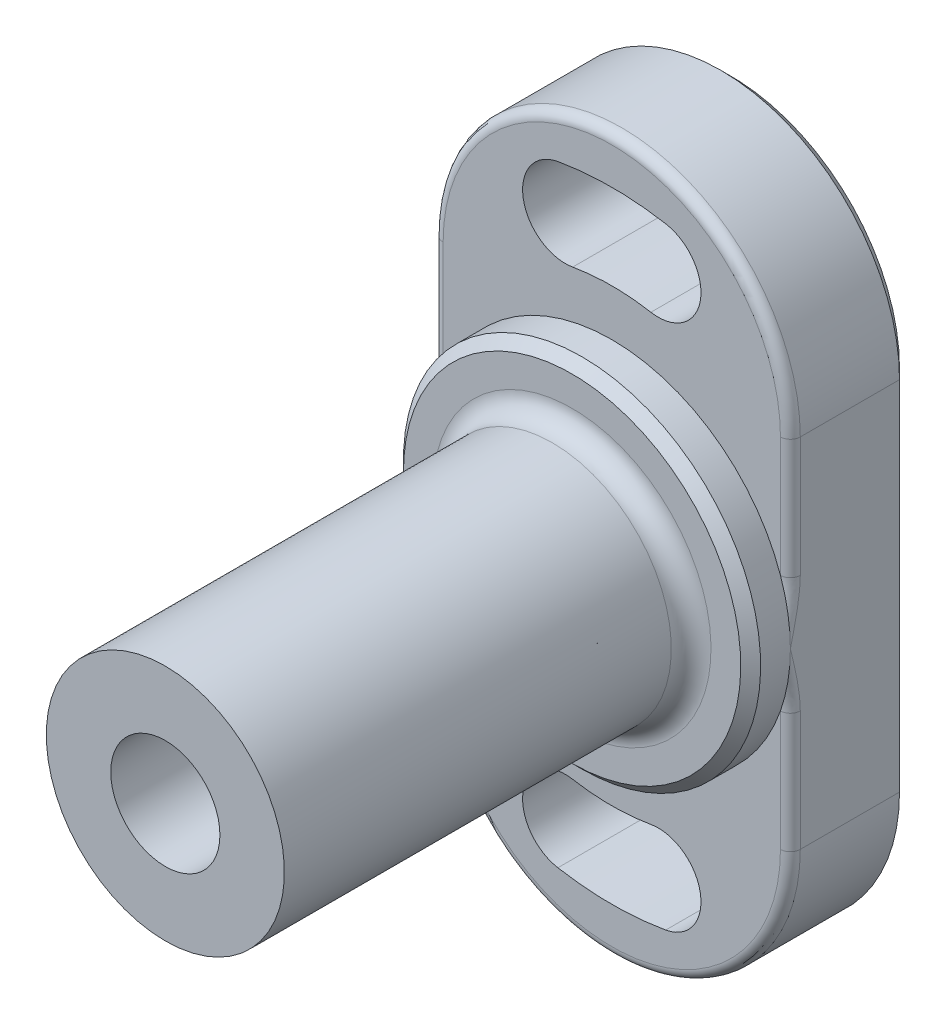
ISO-10303-21;
HEADER;
FILE_DESCRIPTION(('STEP AP214'),'2;1');
FILE_NAME('part.step','',(''),(''),'','','');
FILE_SCHEMA(('AUTOMOTIVE_DESIGN { 1 0 10303 214 1 1 1 1 }'));
ENDSEC;
DATA;
#1=APPLICATION_CONTEXT('core data for automotive mechanical design processes');
#2=APPLICATION_PROTOCOL_DEFINITION('international standard','automotive_design',2000,#1);
#3=PRODUCT_CONTEXT('',#1,'mechanical');
#4=PRODUCT('Part','Part','',(#3));
#5=PRODUCT_RELATED_PRODUCT_CATEGORY('part','',(#4));
#6=PRODUCT_DEFINITION_FORMATION('','',#4);
#7=PRODUCT_DEFINITION_CONTEXT('part definition',#1,'design');
#8=PRODUCT_DEFINITION('design','',#6,#7);
#9=PRODUCT_DEFINITION_SHAPE('','',#8);
#10=(LENGTH_UNIT() NAMED_UNIT(*) SI_UNIT(.MILLI.,.METRE.));
#11=(NAMED_UNIT(*) PLANE_ANGLE_UNIT() SI_UNIT($,.RADIAN.));
#12=(NAMED_UNIT(*) SI_UNIT($,.STERADIAN.) SOLID_ANGLE_UNIT());
#13=UNCERTAINTY_MEASURE_WITH_UNIT(LENGTH_MEASURE(1.E-05),#10,'distance_accuracy_value','');
#14=(GEOMETRIC_REPRESENTATION_CONTEXT(3) GLOBAL_UNCERTAINTY_ASSIGNED_CONTEXT((#13)) GLOBAL_UNIT_ASSIGNED_CONTEXT((#10,
#11,#12)) REPRESENTATION_CONTEXT('',''));
#15=CARTESIAN_POINT('',(0.,0.,0.));
#16=DIRECTION('',(0.,0.,1.));
#17=DIRECTION('',(1.,0.,0.));
#18=AXIS2_PLACEMENT_3D('',#15,#16,#17);
#19=CARTESIAN_POINT('',(0.,9.,6.));
#20=DIRECTION('',(0.,0.,1.));
#21=DIRECTION('',(0.,-1.,0.));
#22=AXIS2_PLACEMENT_3D('',#19,#20,#21);
#23=PLANE('',#22);
#24=CARTESIAN_POINT('',(0.,9.,6.));
#25=DIRECTION('',(0.,0.,1.));
#26=DIRECTION('',(0.,-1.,0.));
#27=AXIS2_PLACEMENT_3D('',#24,#25,#26);
#28=CIRCLE('',#27,8.5);
#29=CARTESIAN_POINT('',(8.5,9.,6.));
#30=VERTEX_POINT('',#29);
#31=CARTESIAN_POINT('',(-8.5,9.,6.));
#32=VERTEX_POINT('',#31);
#33=EDGE_CURVE('E751',#30,#32,#28,.T.);
#34=ORIENTED_EDGE('',*,*,#33,.T.);
#35=DIRECTION('',(0.,-1.,0.));
#36=VECTOR('',#35,1.);
#37=CARTESIAN_POINT('',(-8.5,0.,6.));
#38=LINE('',#37,#36);
#39=CARTESIAN_POINT('',(-8.5,2.9580398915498,6.));
#40=VERTEX_POINT('',#39);
#41=EDGE_CURVE('E536',#32,#40,#38,.T.);
#42=ORIENTED_EDGE('',*,*,#41,.T.);
#43=CARTESIAN_POINT('',(0.,0.,6.));
#44=DIRECTION('',(0.,0.,-1.));
#45=DIRECTION('',(0.,1.,0.));
#46=AXIS2_PLACEMENT_3D('',#43,#44,#45);
#47=CIRCLE('',#46,9.);
#48=CARTESIAN_POINT('',(8.5,2.95803989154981,6.));
#49=VERTEX_POINT('',#48);
#50=EDGE_CURVE('E221',#40,#49,#47,.T.);
#51=ORIENTED_EDGE('',*,*,#50,.T.);
#52=DIRECTION('',(0.,1.,0.));
#53=VECTOR('',#52,1.);
#54=CARTESIAN_POINT('',(8.5,9.,6.));
#55=LINE('',#54,#53);
#56=EDGE_CURVE('E755',#49,#30,#55,.T.);
#57=ORIENTED_EDGE('',*,*,#56,.T.);
#58=EDGE_LOOP('',(#34,#42,#51,#57));
#59=FACE_BOUND('',#58,.T.);
#60=CARTESIAN_POINT('',(-2.34425039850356,13.2949046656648,6.));
#61=DIRECTION('',(0.,0.,1.));
#62=DIRECTION('',(0.,1.,0.));
#63=AXIS2_PLACEMENT_3D('',#60,#61,#62);
#64=CIRCLE('',#63,2.15);
#65=CARTESIAN_POINT('',(-2.71759398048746,15.412241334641,6.));
#66=VERTEX_POINT('',#65);
#67=CARTESIAN_POINT('',(-1.97090681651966,11.1775679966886,6.));
#68=VERTEX_POINT('',#67);
#69=EDGE_CURVE('E252',#66,#68,#64,.T.);
#70=ORIENTED_EDGE('',*,*,#69,.F.);
#71=CARTESIAN_POINT('',(0.,0.,6.));
#72=DIRECTION('',(0.,0.,1.));
#73=DIRECTION('',(0.,-1.,0.));
#74=AXIS2_PLACEMENT_3D('',#71,#72,#73);
#75=CIRCLE('',#74,15.65);
#76=CARTESIAN_POINT('',(2.71759398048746,15.412241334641,6.));
#77=VERTEX_POINT('',#76);
#78=EDGE_CURVE('E250',#77,#66,#75,.T.);
#79=ORIENTED_EDGE('',*,*,#78,.F.);
#80=CARTESIAN_POINT('',(2.34425039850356,13.2949046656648,6.));
#81=DIRECTION('',(0.,0.,1.));
#82=DIRECTION('',(0.,-1.,0.));
#83=AXIS2_PLACEMENT_3D('',#80,#81,#82);
#84=CIRCLE('',#83,2.15);
#85=CARTESIAN_POINT('',(1.97090681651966,11.1775679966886,6.));
#86=VERTEX_POINT('',#85);
#87=EDGE_CURVE('E257',#86,#77,#84,.T.);
#88=ORIENTED_EDGE('',*,*,#87,.F.);
#89=CARTESIAN_POINT('',(0.,0.,6.));
#90=DIRECTION('',(0.,0.,-1.));
#91=DIRECTION('',(0.,-1.,0.));
#92=AXIS2_PLACEMENT_3D('',#89,#90,#91);
#93=CIRCLE('',#92,11.35);
#94=EDGE_CURVE('E254',#68,#86,#93,.T.);
#95=ORIENTED_EDGE('',*,*,#94,.F.);
#96=EDGE_LOOP('',(#70,#79,#88,#95));
#97=FACE_BOUND('',#96,.T.);
#98=ADVANCED_FACE('F14',(#59,#97),#23,.T.);
#99=CARTESIAN_POINT('',(8.5,-2.9580398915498,6.));
#100=VERTEX_POINT('',#99);
#101=CARTESIAN_POINT('',(-8.5,-2.95803989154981,6.));
#102=VERTEX_POINT('',#101);
#103=EDGE_CURVE('E207',#100,#102,#47,.T.);
#104=ORIENTED_EDGE('',*,*,#103,.T.);
#105=DIRECTION('',(0.,-1.,0.));
#106=VECTOR('',#105,1.);
#107=CARTESIAN_POINT('',(-8.5,-9.,6.));
#108=LINE('',#107,#106);
#109=CARTESIAN_POINT('',(-8.5,-9.,6.));
#110=VERTEX_POINT('',#109);
#111=EDGE_CURVE('E285',#102,#110,#108,.T.);
#112=ORIENTED_EDGE('',*,*,#111,.T.);
#113=CARTESIAN_POINT('',(0.,-9.,6.));
#114=DIRECTION('',(0.,0.,1.));
#115=DIRECTION('',(0.,-1.,0.));
#116=AXIS2_PLACEMENT_3D('',#113,#114,#115);
#117=CIRCLE('',#116,8.5);
#118=CARTESIAN_POINT('',(8.5,-9.,6.));
#119=VERTEX_POINT('',#118);
#120=EDGE_CURVE('E279',#110,#119,#117,.T.);
#121=ORIENTED_EDGE('',*,*,#120,.T.);
#122=DIRECTION('',(0.,1.,0.));
#123=VECTOR('',#122,1.);
#124=CARTESIAN_POINT('',(8.5,0.,6.));
#125=LINE('',#124,#123);
#126=EDGE_CURVE('E283',#119,#100,#125,.T.);
#127=ORIENTED_EDGE('',*,*,#126,.T.);
#128=EDGE_LOOP('',(#104,#112,#121,#127));
#129=FACE_BOUND('',#128,.T.);
#130=CARTESIAN_POINT('',(0.,0.,6.));
#131=DIRECTION('',(0.,0.,-1.));
#132=DIRECTION('',(0.,1.,0.));
#133=AXIS2_PLACEMENT_3D('',#130,#131,#132);
#134=CIRCLE('',#133,11.35);
#135=CARTESIAN_POINT('',(1.97090681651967,-11.1775679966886,6.));
#136=VERTEX_POINT('',#135);
#137=CARTESIAN_POINT('',(-1.97090681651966,-11.1775679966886,6.));
#138=VERTEX_POINT('',#137);
#139=EDGE_CURVE('E231',#136,#138,#134,.T.);
#140=ORIENTED_EDGE('',*,*,#139,.F.);
#141=CARTESIAN_POINT('',(2.34425039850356,-13.2949046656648,6.));
#142=DIRECTION('',(0.,0.,1.));
#143=DIRECTION('',(0.,1.,0.));
#144=AXIS2_PLACEMENT_3D('',#141,#142,#143);
#145=CIRCLE('',#144,2.15);
#146=CARTESIAN_POINT('',(2.71759398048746,-15.412241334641,6.));
#147=VERTEX_POINT('',#146);
#148=EDGE_CURVE('E229',#147,#136,#145,.T.);
#149=ORIENTED_EDGE('',*,*,#148,.F.);
#150=CARTESIAN_POINT('',(0.,0.,6.));
#151=DIRECTION('',(0.,0.,1.));
#152=DIRECTION('',(0.,1.,0.));
#153=AXIS2_PLACEMENT_3D('',#150,#151,#152);
#154=CIRCLE('',#153,15.65);
#155=CARTESIAN_POINT('',(-2.71759398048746,-15.412241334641,6.));
#156=VERTEX_POINT('',#155);
#157=EDGE_CURVE('E236',#156,#147,#154,.T.);
#158=ORIENTED_EDGE('',*,*,#157,.F.);
#159=CARTESIAN_POINT('',(-2.34425039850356,-13.2949046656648,6.));
#160=DIRECTION('',(0.,0.,1.));
#161=DIRECTION('',(0.,-1.,0.));
#162=AXIS2_PLACEMENT_3D('',#159,#160,#161);
#163=CIRCLE('',#162,2.15);
#164=EDGE_CURVE('E233',#138,#156,#163,.T.);
#165=ORIENTED_EDGE('',*,*,#164,.F.);
#166=EDGE_LOOP('',(#140,#149,#158,#165));
#167=FACE_BOUND('',#166,.T.);
#168=ADVANCED_FACE('F440',(#129,#167),#23,.T.);
#169=CARTESIAN_POINT('',(0.,9.,0.));
#170=DIRECTION('',(0.,0.,1.));
#171=DIRECTION('',(0.,-1.,0.));
#172=AXIS2_PLACEMENT_3D('',#169,#170,#171);
#173=PLANE('',#172);
#174=DIRECTION('',(0.,1.,0.));
#175=VECTOR('',#174,1.);
#176=CARTESIAN_POINT('',(-8.5,9.,0.));
#177=LINE('',#176,#175);
#178=CARTESIAN_POINT('',(-8.5,-9.,0.));
#179=VERTEX_POINT('',#178);
#180=CARTESIAN_POINT('',(-8.5,9.,0.));
#181=VERTEX_POINT('',#180);
#182=EDGE_CURVE('E592',#179,#181,#177,.T.);
#183=ORIENTED_EDGE('',*,*,#182,.T.);
#184=CARTESIAN_POINT('',(0.,9.,0.));
#185=DIRECTION('',(0.,0.,1.));
#186=DIRECTION('',(0.,-1.,0.));
#187=AXIS2_PLACEMENT_3D('',#184,#185,#186);
#188=CIRCLE('',#187,8.5);
#189=CARTESIAN_POINT('',(8.5,9.,0.));
#190=VERTEX_POINT('',#189);
#191=EDGE_CURVE('E594',#181,#190,#188,.F.);
#192=ORIENTED_EDGE('',*,*,#191,.T.);
#193=DIRECTION('',(0.,-1.,0.));
#194=VECTOR('',#193,1.);
#195=CARTESIAN_POINT('',(8.5,9.,0.));
#196=LINE('',#195,#194);
#197=CARTESIAN_POINT('',(8.5,-9.,0.));
#198=VERTEX_POINT('',#197);
#199=EDGE_CURVE('E590',#190,#198,#196,.T.);
#200=ORIENTED_EDGE('',*,*,#199,.T.);
#201=CARTESIAN_POINT('',(0.,-9.,0.));
#202=DIRECTION('',(0.,0.,1.));
#203=DIRECTION('',(0.,-1.,0.));
#204=AXIS2_PLACEMENT_3D('',#201,#202,#203);
#205=CIRCLE('',#204,8.5);
#206=EDGE_CURVE('E588',#198,#179,#205,.F.);
#207=ORIENTED_EDGE('',*,*,#206,.T.);
#208=EDGE_LOOP('',(#183,#192,#200,#207));
#209=FACE_BOUND('',#208,.T.);
#210=CARTESIAN_POINT('',(-2.34425039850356,-13.2949046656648,0.));
#211=DIRECTION('',(0.,0.,1.));
#212=DIRECTION('',(0.,-1.,0.));
#213=AXIS2_PLACEMENT_3D('',#210,#211,#212);
#214=CIRCLE('',#213,2.65);
#215=CARTESIAN_POINT('',(-1.88408272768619,-10.6851641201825,0.));
#216=VERTEX_POINT('',#215);
#217=CARTESIAN_POINT('',(-2.80441806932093,-15.9046452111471,0.));
#218=VERTEX_POINT('',#217);
#219=EDGE_CURVE('E581',#216,#218,#214,.T.);
#220=ORIENTED_EDGE('',*,*,#219,.T.);
#221=CARTESIAN_POINT('',(0.,0.,0.));
#222=DIRECTION('',(0.,0.,1.));
#223=DIRECTION('',(0.,-1.,0.));
#224=AXIS2_PLACEMENT_3D('',#221,#222,#223);
#225=CIRCLE('',#224,16.15);
#226=CARTESIAN_POINT('',(2.80441806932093,-15.9046452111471,0.));
#227=VERTEX_POINT('',#226);
#228=EDGE_CURVE('E585',#218,#227,#225,.T.);
#229=ORIENTED_EDGE('',*,*,#228,.T.);
#230=CARTESIAN_POINT('',(2.34425039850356,-13.2949046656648,0.));
#231=DIRECTION('',(0.,0.,1.));
#232=DIRECTION('',(0.,-1.,0.));
#233=AXIS2_PLACEMENT_3D('',#230,#231,#232);
#234=CIRCLE('',#233,2.65);
#235=CARTESIAN_POINT('',(1.8840827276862,-10.6851641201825,0.));
#236=VERTEX_POINT('',#235);
#237=EDGE_CURVE('E583',#227,#236,#234,.T.);
#238=ORIENTED_EDGE('',*,*,#237,.T.);
#239=CARTESIAN_POINT('',(0.,0.,0.));
#240=DIRECTION('',(0.,0.,1.));
#241=DIRECTION('',(0.,-1.,0.));
#242=AXIS2_PLACEMENT_3D('',#239,#240,#241);
#243=CIRCLE('',#242,10.85);
#244=EDGE_CURVE('E579',#236,#216,#243,.F.);
#245=ORIENTED_EDGE('',*,*,#244,.T.);
#246=EDGE_LOOP('',(#220,#229,#238,#245));
#247=FACE_BOUND('',#246,.T.);
#248=CARTESIAN_POINT('',(-2.34425039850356,13.2949046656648,0.));
#249=DIRECTION('',(0.,0.,1.));
#250=DIRECTION('',(0.,-1.,0.));
#251=AXIS2_PLACEMENT_3D('',#248,#249,#250);
#252=CIRCLE('',#251,2.65);
#253=CARTESIAN_POINT('',(-2.80441806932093,15.9046452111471,0.));
#254=VERTEX_POINT('',#253);
#255=CARTESIAN_POINT('',(-1.88408272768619,10.6851641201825,0.));
#256=VERTEX_POINT('',#255);
#257=EDGE_CURVE('E572',#254,#256,#252,.T.);
#258=ORIENTED_EDGE('',*,*,#257,.T.);
#259=CARTESIAN_POINT('',(0.,0.,0.));
#260=DIRECTION('',(0.,0.,1.));
#261=DIRECTION('',(0.,-1.,0.));
#262=AXIS2_PLACEMENT_3D('',#259,#260,#261);
#263=CIRCLE('',#262,10.85);
#264=CARTESIAN_POINT('',(1.88408272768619,10.6851641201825,0.));
#265=VERTEX_POINT('',#264);
#266=EDGE_CURVE('E576',#256,#265,#263,.F.);
#267=ORIENTED_EDGE('',*,*,#266,.T.);
#268=CARTESIAN_POINT('',(2.34425039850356,13.2949046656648,0.));
#269=DIRECTION('',(0.,0.,1.));
#270=DIRECTION('',(0.,-1.,0.));
#271=AXIS2_PLACEMENT_3D('',#268,#269,#270);
#272=CIRCLE('',#271,2.65);
#273=CARTESIAN_POINT('',(2.80441806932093,15.9046452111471,0.));
#274=VERTEX_POINT('',#273);
#275=EDGE_CURVE('E574',#265,#274,#272,.T.);
#276=ORIENTED_EDGE('',*,*,#275,.T.);
#277=CARTESIAN_POINT('',(0.,0.,0.));
#278=DIRECTION('',(0.,0.,1.));
#279=DIRECTION('',(0.,-1.,0.));
#280=AXIS2_PLACEMENT_3D('',#277,#278,#279);
#281=CIRCLE('',#280,16.15);
#282=EDGE_CURVE('E570',#274,#254,#281,.T.);
#283=ORIENTED_EDGE('',*,*,#282,.T.);
#284=EDGE_LOOP('',(#258,#267,#276,#283));
#285=FACE_BOUND('',#284,.T.);
#286=ADVANCED_FACE('F446',(#209,#247,#285),#173,.F.);
#287=CARTESIAN_POINT('',(0.,9.,6.));
#288=DIRECTION('',(0.,0.,-1.));
#289=DIRECTION('',(0.,1.,0.));
#290=AXIS2_PLACEMENT_3D('',#287,#288,#289);
#291=CYLINDRICAL_SURFACE('',#290,9.);
#292=DIRECTION('',(0.,0.,-1.));
#293=VECTOR('',#292,1.);
#294=CARTESIAN_POINT('',(9.,9.,6.));
#295=LINE('',#294,#293);
#296=CARTESIAN_POINT('',(9.,9.,5.5));
#297=VERTEX_POINT('',#296);
#298=CARTESIAN_POINT('',(9.,9.,0.5));
#299=VERTEX_POINT('',#298);
#300=EDGE_CURVE('E268',#297,#299,#295,.T.);
#301=ORIENTED_EDGE('',*,*,#300,.T.);
#302=CARTESIAN_POINT('',(0.,9.,0.5));
#303=DIRECTION('',(0.,0.,1.));
#304=DIRECTION('',(0.,-1.,0.));
#305=AXIS2_PLACEMENT_3D('',#302,#303,#304);
#306=CIRCLE('',#305,9.);
#307=CARTESIAN_POINT('',(-9.,9.,0.5));
#308=VERTEX_POINT('',#307);
#309=EDGE_CURVE('E567',#299,#308,#306,.T.);
#310=ORIENTED_EDGE('',*,*,#309,.T.);
#311=DIRECTION('',(0.,0.,-1.));
#312=VECTOR('',#311,1.);
#313=CARTESIAN_POINT('',(-9.,9.,6.));
#314=LINE('',#313,#312);
#315=CARTESIAN_POINT('',(-9.,9.,5.5));
#316=VERTEX_POINT('',#315);
#317=EDGE_CURVE('E276',#316,#308,#314,.T.);
#318=ORIENTED_EDGE('',*,*,#317,.F.);
#319=CARTESIAN_POINT('',(0.,9.,5.5));
#320=DIRECTION('',(0.,0.,1.));
#321=DIRECTION('',(0.,-1.,0.));
#322=AXIS2_PLACEMENT_3D('',#319,#320,#321);
#323=CIRCLE('',#322,9.);
#324=EDGE_CURVE('E534',#316,#297,#323,.F.);
#325=ORIENTED_EDGE('',*,*,#324,.T.);
#326=EDGE_LOOP('',(#301,#310,#318,#325));
#327=FACE_BOUND('',#326,.T.);
#328=ADVANCED_FACE('F312',(#327),#291,.T.);
#329=CARTESIAN_POINT('',(-9.,9.,6.));
#330=DIRECTION('',(1.,0.,0.));
#331=DIRECTION('',(0.,1.,0.));
#332=AXIS2_PLACEMENT_3D('',#329,#330,#331);
#333=PLANE('',#332);
#334=ORIENTED_EDGE('',*,*,#317,.T.);
#335=DIRECTION('',(0.,-1.,0.));
#336=VECTOR('',#335,1.);
#337=CARTESIAN_POINT('',(-9.,9.,0.5));
#338=LINE('',#337,#336);
#339=CARTESIAN_POINT('',(-9.,-9.,0.5));
#340=VERTEX_POINT('',#339);
#341=EDGE_CURVE('E597',#308,#340,#338,.T.);
#342=ORIENTED_EDGE('',*,*,#341,.T.);
#343=DIRECTION('',(0.,0.,-1.));
#344=VECTOR('',#343,1.);
#345=CARTESIAN_POINT('',(-9.,-9.,6.));
#346=LINE('',#345,#344);
#347=CARTESIAN_POINT('',(-9.,-9.,5.5));
#348=VERTEX_POINT('',#347);
#349=EDGE_CURVE('E273',#348,#340,#346,.T.);
#350=ORIENTED_EDGE('',*,*,#349,.F.);
#351=DIRECTION('',(0.,-1.,0.));
#352=VECTOR('',#351,1.);
#353=CARTESIAN_POINT('',(-9.,0.,5.5));
#354=LINE('',#353,#352);
#355=CARTESIAN_POINT('',(-9.,-2.95803989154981,5.5));
#356=VERTEX_POINT('',#355);
#357=EDGE_CURVE('E758',#348,#356,#354,.F.);
#358=ORIENTED_EDGE('',*,*,#357,.T.);
#359=CARTESIAN_POINT('',(-8.2208819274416,-3.66293602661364,6.));
#360=CARTESIAN_POINT('',(-8.46998077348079,-3.6126907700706,6.15989272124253));
#361=CARTESIAN_POINT('',(-8.73499038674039,-3.65499241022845,6.02527853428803));
#362=CARTESIAN_POINT('',(-9.,-3.6972940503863,5.89066434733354));
#363=CARTESIAN_POINT('',(-9.,-3.78730122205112,5.6042394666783));
#364=CARTESIAN_POINT('',(-8.23337827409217,-3.63489269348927,6.));
#365=CARTESIAN_POINT('',(-8.48321001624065,-3.59154052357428,6.1511832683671));
#366=CARTESIAN_POINT('',(-8.74163327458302,-3.63107648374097,6.01404360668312));
#367=CARTESIAN_POINT('',(-9.,-3.67083903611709,5.87700198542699));
#368=CARTESIAN_POINT('',(-9.,-3.75254737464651,5.59334290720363));
#369=CARTESIAN_POINT('',(-8.24591068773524,-3.60637707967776,6.));
#370=CARTESIAN_POINT('',(-8.49599503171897,-3.56869841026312,6.14248193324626));
#371=CARTESIAN_POINT('',(-8.74802236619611,-3.60570042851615,6.00327400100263));
#372=CARTESIAN_POINT('',(-9.,-3.64292294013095,5.86414955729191));
#373=CARTESIAN_POINT('',(-9.,-3.71744982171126,5.58362221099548));
#374=CARTESIAN_POINT('',(-8.27095223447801,-3.5485680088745,6.));
#375=CARTESIAN_POINT('',(-8.52062748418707,-3.52050913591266,6.1254207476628));
#376=CARTESIAN_POINT('',(-8.76033917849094,-3.55268706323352,5.98274249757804));
#377=CARTESIAN_POINT('',(-9.,-3.58507743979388,5.84014841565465));
#378=CARTESIAN_POINT('',(-9.,-3.64678557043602,5.56621537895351));
#379=CARTESIAN_POINT('',(-8.2834613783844,-3.5192753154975,6.));
#380=CARTESIAN_POINT('',(-8.53249178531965,-3.49516818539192,6.11705199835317));
#381=CARTESIAN_POINT('',(-8.76626733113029,-3.52505192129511,5.97297965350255));
#382=CARTESIAN_POINT('',(-9.,-3.55514651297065,5.82897613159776));
#383=CARTESIAN_POINT('',(-9.,-3.6112193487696,5.55852732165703));
#384=CARTESIAN_POINT('',(-8.3083426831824,-3.46012566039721,6.));
#385=CARTESIAN_POINT('',(-8.55536109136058,-3.44269986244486,6.1008917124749));
#386=CARTESIAN_POINT('',(-8.7777014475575,-3.46822824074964,5.9545485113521));
#387=CARTESIAN_POINT('',(-9.,-3.49396657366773,5.8082729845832));
#388=CARTESIAN_POINT('',(-9.,-3.53989069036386,5.54487238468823));
#389=CARTESIAN_POINT('',(-8.32071516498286,-3.43027095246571,6.));
#390=CARTESIAN_POINT('',(-8.5663813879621,-3.41557758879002,6.09308969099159));
#391=CARTESIAN_POINT('',(-8.78320877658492,-3.4390452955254,5.94587660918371));
#392=CARTESIAN_POINT('',(-9.,-3.46271532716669,5.79871904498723));
#393=CARTESIAN_POINT('',(-9.,-3.50412932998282,5.53889974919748));
#394=CARTESIAN_POINT('',(-8.34531763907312,-3.36997540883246,6.));
#395=CARTESIAN_POINT('',(-8.5876980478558,-3.35985449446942,6.07808948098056));
#396=CARTESIAN_POINT('',(-8.79386695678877,-3.37940147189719,5.92955188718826));
#397=CARTESIAN_POINT('',(-9.,-3.39914921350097,5.78106910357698));
#398=CARTESIAN_POINT('',(-9.,-3.43238576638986,5.52841769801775));
#399=CARTESIAN_POINT('',(-8.35754759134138,-3.33953441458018,6.));
#400=CARTESIAN_POINT('',(-8.5980046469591,-3.33124863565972,6.07088348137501));
#401=CARTESIAN_POINT('',(-8.79901770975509,-3.34894024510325,5.92189934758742));
#402=CARTESIAN_POINT('',(-9.,-3.36682458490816,5.77295909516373));
#403=CARTESIAN_POINT('',(-9.,-3.39640350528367,5.5239086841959));
#404=CARTESIAN_POINT('',(-8.39365940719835,-3.24818878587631,6.));
#405=CARTESIAN_POINT('',(-8.62761316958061,-3.24465601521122,6.05044760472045));
#406=CARTESIAN_POINT('',(-8.8138669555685,-3.25684074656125,5.90057563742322));
#407=CARTESIAN_POINT('',(-9.,-3.2697706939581,5.75087766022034));
#408=CARTESIAN_POINT('',(-9.,-3.28913743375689,5.51239131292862));
#409=CARTESIAN_POINT('',(-8.4172713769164,-3.18653051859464,6.));
#410=CARTESIAN_POINT('',(-8.64610964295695,-3.18467288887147,6.03803522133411));
#411=CARTESIAN_POINT('',(-8.82310107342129,-3.19377226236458,5.88831421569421));
#412=CARTESIAN_POINT('',(-9.,-3.20354841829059,5.73870647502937));
#413=CARTESIAN_POINT('',(-9.,-3.21765285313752,5.5072347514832));
#414=CARTESIAN_POINT('',(-8.4635585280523,-3.06147570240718,6.));
#415=CARTESIAN_POINT('',(-8.68098295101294,-3.06159778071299,6.01561415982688));
#416=CARTESIAN_POINT('',(-8.84053659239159,-3.06510990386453,5.86710780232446));
#417=CARTESIAN_POINT('',(-9.,-3.06929367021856,5.71871044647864));
#418=CARTESIAN_POINT('',(-9.,-3.07446112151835,5.50087160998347));
#419=CARTESIAN_POINT('',(-8.48623272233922,-2.99807743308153,6.));
#420=CARTESIAN_POINT('',(-8.69740446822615,-2.99844731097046,6.00556700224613));
#421=CARTESIAN_POINT('',(-8.84873692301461,-2.99951350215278,5.85816623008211));
#422=CARTESIAN_POINT('',(-9.,-3.0011825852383,5.71083065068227));
#423=CARTESIAN_POINT('',(-9.,-3.00275381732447,5.49966909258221));
#424=CARTESIAN_POINT('',(-8.54617911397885,-2.82422921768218,6.));
#425=CARTESIAN_POINT('',(-8.73931370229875,-2.82488744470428,5.98140172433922));
#426=CARTESIAN_POINT('',(-8.86975981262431,-2.81944170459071,5.83782413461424));
#427=CARTESIAN_POINT('',(-9.,-2.81574520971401,5.69444907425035));
#428=CARTESIAN_POINT('',(-9.,-2.80842668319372,5.50077744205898));
#429=CARTESIAN_POINT('',(-8.58237931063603,-2.71234757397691,6.));
#430=CARTESIAN_POINT('',(-8.76331851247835,-2.7116047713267,5.96921219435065));
#431=CARTESIAN_POINT('',(-8.88172776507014,-2.70334577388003,5.82918899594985));
#432=CARTESIAN_POINT('',(-9.,-2.69653500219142,5.68923868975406));
#433=CARTESIAN_POINT('',(-9.,-2.68582547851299,5.50619093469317));
#434=CARTESIAN_POINT('',(-8.65096048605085,-2.48495937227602,6.));
#435=CARTESIAN_POINT('',(-8.80698123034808,-2.48125396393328,5.95019396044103));
#436=CARTESIAN_POINT('',(-8.90355555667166,-2.46839605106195,5.81847860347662));
#437=CARTESIAN_POINT('',(-9.,-2.45696246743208,5.68682138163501));
#438=CARTESIAN_POINT('',(-9.,-2.44110981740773,5.52396352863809));
#439=CARTESIAN_POINT('',(-8.68333910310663,-2.36945062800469,6.));
#440=CARTESIAN_POINT('',(-8.8267452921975,-2.3639326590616,5.94327919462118));
#441=CARTESIAN_POINT('',(-8.91341409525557,-2.3495406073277,5.81640738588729));
#442=CARTESIAN_POINT('',(-9.,-2.33630484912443,5.68951942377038));
#443=CARTESIAN_POINT('',(-9.,-2.31899570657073,5.53632689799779));
#444=CARTESIAN_POINT('',(-8.77415856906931,-2.01806938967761,6.));
#445=CARTESIAN_POINT('',(-8.88025654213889,-2.00984119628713,5.92906882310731));
#446=CARTESIAN_POINT('',(-8.94030542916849,-1.99028734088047,5.81783885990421));
#447=CARTESIAN_POINT('',(-9.,-1.97537060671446,5.70661320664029));
#448=CARTESIAN_POINT('',(-9.,-1.95333361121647,5.58128162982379));
#449=CARTESIAN_POINT('',(-8.82618667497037,-1.7776175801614,6.));
#450=CARTESIAN_POINT('',(-8.90910342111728,-1.76644594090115,5.92790868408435));
#451=CARTESIAN_POINT('',(-8.95462271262,-1.74749199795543,5.82901083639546));
#452=CARTESIAN_POINT('',(-9.00000000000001,-1.731442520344,5.72993275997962));
#453=CARTESIAN_POINT('',(-9.,-1.71077176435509,5.62172636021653));
#454=CARTESIAN_POINT('',(-8.91114068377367,-1.28624034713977,6.));
#455=CARTESIAN_POINT('',(-8.95467056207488,-1.27423679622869,5.93621660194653));
#456=CARTESIAN_POINT('',(-8.97739850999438,-1.25732921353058,5.86347264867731));
#457=CARTESIAN_POINT('',(-9.,-1.24329449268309,5.7905027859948));
#458=CARTESIAN_POINT('',(-9.,-1.22572379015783,5.71485272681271));
#459=CARTESIAN_POINT('',(-8.94387348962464,-1.03523511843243,6.));
#460=CARTESIAN_POINT('',(-8.97156429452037,-1.02382047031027,5.94569074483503));
#461=CARTESIAN_POINT('',(-8.98579795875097,-1.00994029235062,5.88688069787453));
#462=CARTESIAN_POINT('',(-8.99999999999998,-0.997475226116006,5.82792406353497));
#463=CARTESIAN_POINT('',(-9.,-0.983261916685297,5.76765091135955));
#464=CARTESIAN_POINT('',(-8.98801628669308,-0.529159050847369,6.));
#465=CARTESIAN_POINT('',(-8.99402201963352,-0.522554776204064,5.96971717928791));
#466=CARTESIAN_POINT('',(-8.99702699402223,-0.514514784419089,5.93945130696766));
#467=CARTESIAN_POINT('',(-9.00000000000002,-0.507865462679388,5.90903431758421));
#468=CARTESIAN_POINT('',(-9.,-0.499833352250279,5.87883538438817));
#469=CARTESIAN_POINT('',(-8.99944183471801,-0.274091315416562,6.));
#470=CARTESIAN_POINT('',(-8.99972108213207,-0.270302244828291,5.98430455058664));
#471=CARTESIAN_POINT('',(-8.99986064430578,-0.26647880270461,5.9686096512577));
#472=CARTESIAN_POINT('',(-9.00000000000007,-0.262688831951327,5.95291091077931));
#473=CARTESIAN_POINT('',(-9.,-0.258865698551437,5.93721756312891));
#474=CARTESIAN_POINT('',(-8.99998667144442,-0.0158110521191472,6.));
#475=CARTESIAN_POINT('',(-8.99999333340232,-0.0155914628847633,5.99909459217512));
#476=CARTESIAN_POINT('',(-8.99999666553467,-0.0153718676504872,5.99818916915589));
#477=CARTESIAN_POINT('',(-9.,-0.0151522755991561,5.99728374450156));
#478=CARTESIAN_POINT('',(-9.,-0.014932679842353,5.99637831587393));
#479=CARTESIAN_POINT('',(-8.99999166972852,-0.0126484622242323,6.));
#480=CARTESIAN_POINT('',(-8.99999583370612,-0.0124727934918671,5.99927569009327));
#481=CARTESIAN_POINT('',(-8.99999791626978,-0.0122971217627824,5.99855137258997));
#482=CARTESIAN_POINT('',(-9.,-0.0121214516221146,5.99782705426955));
#483=CARTESIAN_POINT('',(-9.,-0.0119457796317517,5.99710273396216));
#484=CARTESIAN_POINT('',(-8.99999833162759,-0.00632391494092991,6.));
#485=CARTESIAN_POINT('',(-8.99999916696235,-0.00623608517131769,5.99963785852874));
#486=CARTESIAN_POINT('',(-8.99999958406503,-0.00614825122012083,5.9992757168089));
#487=CARTESIAN_POINT('',(-9.,-0.0060604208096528,5.99891357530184));
#488=CARTESIAN_POINT('',(-9.,-0.00597258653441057,5.99855143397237));
#489=CARTESIAN_POINT('',(-8.99999999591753,-0.00316195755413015,6.));
#490=CARTESIAN_POINT('',(-9.00000000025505,-0.0031180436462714,5.99981892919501));
#491=CARTESIAN_POINT('',(-9.0000000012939,-0.00307412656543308,5.99963785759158));
#492=CARTESIAN_POINT('',(-9.,-0.00303021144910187,5.99945678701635));
#493=CARTESIAN_POINT('',(-9.,-0.00298629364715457,5.99927571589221));
#494=CARTESIAN_POINT('',(-9.,0.,6.));
#495=CARTESIAN_POINT('',(-9.,0.,6.));
#496=CARTESIAN_POINT('',(-9.,0.,6.));
#497=CARTESIAN_POINT('',(-9.,0.,6.));
#498=CARTESIAN_POINT('',(-9.,0.,6.));
#499=(BOUNDED_SURFACE() B_SPLINE_SURFACE(3,2,((#359,#360,#361,#362,#363),(#364,#365,#366,#367,
#368),(#369,#370,#371,#372,#373),(#374,#375,#376,#377,#378),(#379,#380,#381,#382,#383),(#384,
#385,#386,#387,#388),(#389,#390,#391,#392,#393),(#394,#395,#396,#397,#398),(#399,#400,#401,#402,
#403),(#404,#405,#406,#407,#408),(#409,#410,#411,#412,#413),(#414,#415,#416,#417,#418),(#419,
#420,#421,#422,#423),(#424,#425,#426,#427,#428),(#429,#430,#431,#432,#433),(#434,#435,#436,#437,
#438),(#439,#440,#441,#442,#443),(#444,#445,#446,#447,#448),(#449,#450,#451,#452,#453),(#454,
#455,#456,#457,#458),(#459,#460,#461,#462,#463),(#464,#465,#466,#467,#468),(#469,#470,#471,#472,
#473),(#474,#475,#476,#477,#478),(#479,#480,#481,#482,#483),(#484,#485,#486,#487,#488),(#489,
#490,#491,#492,#493),(#494,#495,#496,#497,#498)),.UNSPECIFIED.,.F.,.F.,
.F.) B_SPLINE_SURFACE_WITH_KNOTS((4,2,2,2,2,2,2,2,2,2,2,2,2,4),(3,2,3),(0.,0.10921101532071,
0.218318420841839,0.327055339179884,0.435822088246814,0.650675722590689,0.86575004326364,
1.23360679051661,1.601689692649,2.33877019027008,3.08310699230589,3.82690012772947,
3.83612060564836,3.84533921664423),(0.,0.5,1.),
.UNSPECIFIED.) GEOMETRIC_REPRESENTATION_ITEM() RATIONAL_B_SPLINE_SURFACE(((1.,0.857315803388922,
1.,0.857315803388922,1.),(1.,0.861189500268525,1.,0.861189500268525,1.),(1.,0.86488999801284,1.,
0.86488999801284,1.),(1.,0.87198164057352,1.,0.87198164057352,1.),(1.,0.875373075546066,1.,
0.875373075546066,1.),(1.,0.88187976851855,1.,0.88187976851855,1.),(1.,0.884995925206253,1.,
0.884995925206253,1.),(1.,0.890997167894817,1.,0.890997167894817,1.),(1.,0.893882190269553,1.,
0.893882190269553,1.),(1.,0.902162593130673,1.,0.902162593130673,1.),(1.,0.907261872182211,1.,
0.907261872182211,1.),(1.,0.916820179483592,1.,0.916820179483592,1.),(1.,0.921278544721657,1.,
0.921278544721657,1.),(1.,0.932636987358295,1.,0.932636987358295,1.),(1.,0.939021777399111,1.,
0.939021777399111,1.),(1.,0.950572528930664,1.,0.950572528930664,1.),(1.,0.955737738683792,1.,
0.955737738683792,1.),(1.,0.969739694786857,1.,0.969739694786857,1.),(1.,0.977066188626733,1.,
0.977066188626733,1.),(1.,0.98865057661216,1.,0.98865057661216,1.),(1.,0.992877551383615,1.,
0.992877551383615,1.),(1.,0.998516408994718,1.,0.998516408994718,1.),(1.,0.999930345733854,1.,
0.999930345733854,1.),(1.,0.999998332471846,1.,0.999998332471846,1.),(1.,0.999998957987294,1.,
0.999998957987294,1.),(1.,0.999999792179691,1.,0.999999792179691,1.),(1.,1.00000000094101,1.,
1.00000000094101,1.),(1.,1.,1.,1.,1.))) REPRESENTATION_ITEM('') SURFACE());
#500=CARTESIAN_POINT('',(-9.,-3.78730122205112,5.6042394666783));
#501=CARTESIAN_POINT('',(-9.,-3.75254737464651,5.59334290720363));
#502=CARTESIAN_POINT('',(-9.,-3.71744982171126,5.58362221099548));
#503=CARTESIAN_POINT('',(-9.,-3.64678557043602,5.56621537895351));
#504=CARTESIAN_POINT('',(-9.,-3.6112193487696,5.55852732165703));
#505=CARTESIAN_POINT('',(-9.,-3.53989069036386,5.54487238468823));
#506=CARTESIAN_POINT('',(-9.,-3.50412932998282,5.53889974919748));
#507=CARTESIAN_POINT('',(-9.,-3.43238576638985,5.52841769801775));
#508=CARTESIAN_POINT('',(-9.,-3.39640350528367,5.5239086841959));
#509=CARTESIAN_POINT('',(-9.,-3.28913743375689,5.51239131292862));
#510=CARTESIAN_POINT('',(-9.,-3.21765285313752,5.5072347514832));
#511=CARTESIAN_POINT('',(-9.,-3.07446112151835,5.50087160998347));
#512=CARTESIAN_POINT('',(-9.,-3.00275381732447,5.49966909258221));
#513=CARTESIAN_POINT('',(-9.,-2.80842668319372,5.50077744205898));
#514=CARTESIAN_POINT('',(-9.,-2.68582547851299,5.50619093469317));
#515=CARTESIAN_POINT('',(-9.,-2.44110981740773,5.52396352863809));
#516=CARTESIAN_POINT('',(-9.,-2.31899570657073,5.53632689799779));
#517=CARTESIAN_POINT('',(-9.,-1.95333361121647,5.58128162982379));
#518=CARTESIAN_POINT('',(-9.,-1.71077176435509,5.62172636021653));
#519=CARTESIAN_POINT('',(-9.,-1.22572379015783,5.71485272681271));
#520=CARTESIAN_POINT('',(-9.,-0.983261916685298,5.76765091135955));
#521=CARTESIAN_POINT('',(-9.,-0.499833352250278,5.87883538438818));
#522=CARTESIAN_POINT('',(-9.,-0.258865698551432,5.93721756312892));
#523=CARTESIAN_POINT('',(-9.,-0.014932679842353,5.99637831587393));
#524=CARTESIAN_POINT('',(-9.,-0.0119457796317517,5.99710273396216));
#525=CARTESIAN_POINT('',(-9.,-0.0059725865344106,5.99855143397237));
#526=CARTESIAN_POINT('',(-9.,-0.00298629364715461,5.99927571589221));
#527=CARTESIAN_POINT('',(-9.,0.,6.));
#528=B_SPLINE_CURVE_WITH_KNOTS('',3,(#500,#501,#502,#503,#504,#505,#506,#507,#508,#509,#510,
#511,#512,#513,#514,#515,#516,#517,#518,#519,#520,#521,#522,#523,#524,#525,#526,#527),
.UNSPECIFIED.,.F.,.F.,(4,2,2,2,2,2,2,2,2,2,2,2,2,4),(0.,0.10921101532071,0.218318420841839,
0.327055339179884,0.435822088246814,0.650675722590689,0.86575004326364,1.23360679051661,
1.601689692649,2.33877019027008,3.08310699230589,3.82690012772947,3.83612060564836,
3.84533921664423),.UNSPECIFIED.);
#529=CARTESIAN_POINT('',(-9.,0.,6.));
#530=VERTEX_POINT('',#529);
#531=EDGE_CURVE('E297',#356,#530,#528,.T.);
#532=ORIENTED_EDGE('',*,*,#531,.T.);
#533=CARTESIAN_POINT('',(-9.,3.78730122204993,5.60423946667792));
#534=CARTESIAN_POINT('',(-9.,3.69729404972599,5.89066434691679));
#535=CARTESIAN_POINT('',(-8.73499038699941,3.65499240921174,6.02527853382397));
#536=CARTESIAN_POINT('',(-8.46998077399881,3.61269076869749,6.15989272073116));
#537=CARTESIAN_POINT('',(-8.22088192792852,3.66293602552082,6.));
#538=CARTESIAN_POINT('',(-9.,3.7525473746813,5.5933429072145));
#539=CARTESIAN_POINT('',(-9.,3.67083903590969,5.87700198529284));
#540=CARTESIAN_POINT('',(-8.74163327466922,3.63107648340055,6.01404360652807));
#541=CARTESIAN_POINT('',(-8.48321001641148,3.59154052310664,6.15118326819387));
#542=CARTESIAN_POINT('',(-8.23337827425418,3.63489269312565,6.));
#543=CARTESIAN_POINT('',(-9.,3.71744982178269,5.58362221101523));
#544=CARTESIAN_POINT('',(-9.,3.64292294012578,5.86414955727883));
#545=CARTESIAN_POINT('',(-8.74802236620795,3.6057004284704,6.00327400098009));
#546=CARTESIAN_POINT('',(-8.49599503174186,3.56869841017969,6.14248193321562));
#547=CARTESIAN_POINT('',(-8.2459106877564,3.60637707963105,6.));
#548=CARTESIAN_POINT('',(-9.,3.6467855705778,5.56621537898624));
#549=CARTESIAN_POINT('',(-9.,3.58507743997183,5.84014841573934));
#550=CARTESIAN_POINT('',(-8.76033917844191,3.55268706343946,5.98274249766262));
#551=CARTESIAN_POINT('',(-8.52062748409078,3.52050913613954,6.12542074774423));
#552=CARTESIAN_POINT('',(-8.27095223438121,3.54856800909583,6.));
#553=CARTESIAN_POINT('',(-9.,3.61121934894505,5.55852732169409));
#554=CARTESIAN_POINT('',(-9.,3.55514651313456,5.82897613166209));
#555=CARTESIAN_POINT('',(-8.76626733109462,3.52505192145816,5.972979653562));
#556=CARTESIAN_POINT('',(-8.53249178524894,3.49516818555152,6.11705199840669));
#557=CARTESIAN_POINT('',(-8.28346137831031,3.51927531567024,6.));
#558=CARTESIAN_POINT('',(-9.,3.53989069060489,5.54487238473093));
#559=CARTESIAN_POINT('',(-9.,3.49396657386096,5.80827298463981));
#560=CARTESIAN_POINT('',(-8.7777014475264,3.46822824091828,5.95454851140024));
#561=CARTESIAN_POINT('',(-8.5553610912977,3.44269986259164,6.10089171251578));
#562=CARTESIAN_POINT('',(-8.30834268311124,3.46012566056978,6.));
#563=CARTESIAN_POINT('',(-9.,3.50412933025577,5.5388997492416));
#564=CARTESIAN_POINT('',(-9.,3.46271532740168,5.79871904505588));
#565=CARTESIAN_POINT('',(-8.78320877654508,3.4390452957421,5.94587660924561));
#566=CARTESIAN_POINT('',(-8.56638138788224,3.41557758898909,6.09308969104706));
#567=CARTESIAN_POINT('',(-8.32071516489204,3.43027095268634,6.));
#568=CARTESIAN_POINT('',(-9.,3.43238576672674,5.52841769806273));
#569=CARTESIAN_POINT('',(-9.,3.39914921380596,5.7810691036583));
#570=CARTESIAN_POINT('',(-8.79386695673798,3.37940147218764,5.92955188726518));
#571=CARTESIAN_POINT('',(-8.58769804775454,3.35985449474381,6.07808948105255));
#572=CARTESIAN_POINT('',(-8.34531763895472,3.36997540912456,6.));
#573=CARTESIAN_POINT('',(-9.,3.39640350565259,5.52390868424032));
#574=CARTESIAN_POINT('',(-9.,3.36682458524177,5.77295909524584));
#575=CARTESIAN_POINT('',(-8.79901770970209,3.34894024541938,5.92189934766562));
#576=CARTESIAN_POINT('',(-8.59800464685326,3.33124863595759,6.07088348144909));
#577=CARTESIAN_POINT('',(-8.35754759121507,3.33953441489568,6.));
#578=CARTESIAN_POINT('',(-9.,3.2891374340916,5.51239131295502));
#579=CARTESIAN_POINT('',(-9.,3.2697706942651,5.75087766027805));
#580=CARTESIAN_POINT('',(-8.81386695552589,3.25684074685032,5.90057563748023));
#581=CARTESIAN_POINT('',(-8.62761316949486,3.24465601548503,6.05044760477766));
#582=CARTESIAN_POINT('',(-8.39365940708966,3.24818878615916,6.));
#583=CARTESIAN_POINT('',(-9.,3.21765285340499,5.5072347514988));
#584=CARTESIAN_POINT('',(-9.,3.20354841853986,5.73870647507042));
#585=CARTESIAN_POINT('',(-8.82310107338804,3.19377226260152,5.88831421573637));
#586=CARTESIAN_POINT('',(-8.64610964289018,3.18467288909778,6.03803522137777));
#587=CARTESIAN_POINT('',(-8.41727137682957,3.18653051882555,6.));
#588=CARTESIAN_POINT('',(-9.,3.07446112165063,5.50087160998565));
#589=CARTESIAN_POINT('',(-9.,3.0692936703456,5.7187104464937));
#590=CARTESIAN_POINT('',(-8.84053659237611,3.065109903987,5.86710780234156));
#591=CARTESIAN_POINT('',(-8.68098295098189,3.06159778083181,6.01561415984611));
#592=CARTESIAN_POINT('',(-8.46355852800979,3.06147570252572,6.));
#593=CARTESIAN_POINT('',(-9.,3.00275381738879,5.49966909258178));
#594=CARTESIAN_POINT('',(-9.,3.00118258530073,5.71083065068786));
#595=CARTESIAN_POINT('',(-8.84873692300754,2.99951350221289,5.85816623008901));
#596=CARTESIAN_POINT('',(-8.69740446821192,2.99844731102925,6.0055670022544));
#597=CARTESIAN_POINT('',(-8.48623272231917,2.99807743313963,6.));
#598=CARTESIAN_POINT('',(-9.,2.80842668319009,5.5007774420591));
#599=CARTESIAN_POINT('',(-9.,2.81574520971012,5.69444907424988));
#600=CARTESIAN_POINT('',(-8.86975981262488,2.81944170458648,5.83782413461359));
#601=CARTESIAN_POINT('',(-8.73931370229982,2.82488744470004,5.98140172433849));
#602=CARTESIAN_POINT('',(-8.54617911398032,2.824229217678,6.));
#603=CARTESIAN_POINT('',(-9.,2.68582547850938,5.50619093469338));
#604=CARTESIAN_POINT('',(-9.,2.6965350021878,5.68923868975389));
#605=CARTESIAN_POINT('',(-8.88172776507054,2.70334577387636,5.82918899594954));
#606=CARTESIAN_POINT('',(-8.76331851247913,2.71160477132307,5.96921219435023));
#607=CARTESIAN_POINT('',(-8.58237931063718,2.71234757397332,6.));
#608=CARTESIAN_POINT('',(-9.,2.44110981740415,5.52396352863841));
#609=CARTESIAN_POINT('',(-9.,2.45696246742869,5.68682138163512));
#610=CARTESIAN_POINT('',(-8.9035555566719,2.46839605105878,5.81847860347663));
#611=CARTESIAN_POINT('',(-8.80698123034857,2.48125396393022,5.9501939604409));
#612=CARTESIAN_POINT('',(-8.65096048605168,2.48495937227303,6.));
#613=CARTESIAN_POINT('',(-9.,2.31899570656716,5.53632689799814));
#614=CARTESIAN_POINT('',(-9.,2.33630484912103,5.68951942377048));
#615=CARTESIAN_POINT('',(-8.91341409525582,2.34954060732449,5.81640738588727));
#616=CARTESIAN_POINT('',(-8.82674529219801,2.36393265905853,5.94327919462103));
#617=CARTESIAN_POINT('',(-8.68333910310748,2.36945062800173,6.));
#618=CARTESIAN_POINT('',(-9.,1.95333361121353,5.58128162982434));
#619=CARTESIAN_POINT('',(-9.,1.97537060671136,5.70661320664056));
#620=CARTESIAN_POINT('',(-8.94030542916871,1.99028734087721,5.8178388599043));
#621=CARTESIAN_POINT('',(-8.88025654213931,2.00984119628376,5.92906882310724));
#622=CARTESIAN_POINT('',(-8.77415856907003,2.01806938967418,6.));
#623=CARTESIAN_POINT('',(-9.,1.71077176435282,5.62172636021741));
#624=CARTESIAN_POINT('',(-9.,1.73144252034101,5.72993275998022));
#625=CARTESIAN_POINT('',(-8.95462271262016,1.74749199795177,5.8290108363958));
#626=CARTESIAN_POINT('',(-8.90910342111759,1.76644594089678,5.92790868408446));
#627=CARTESIAN_POINT('',(-8.82618667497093,1.77761758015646,6.));
#628=CARTESIAN_POINT('',(-9.,1.22572379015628,5.71485272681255));
#629=CARTESIAN_POINT('',(-9.,1.24329449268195,5.79050278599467));
#630=CARTESIAN_POINT('',(-8.97739850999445,1.25732921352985,5.86347264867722));
#631=CARTESIAN_POINT('',(-8.95467056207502,1.27423679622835,5.93621660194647));
#632=CARTESIAN_POINT('',(-8.91114068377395,1.28624034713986,6.));
#633=CARTESIAN_POINT('',(-9.,0.98326191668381,5.76765091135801));
#634=CARTESIAN_POINT('',(-8.99999999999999,0.997475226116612,5.8279240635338));
#635=CARTESIAN_POINT('',(-8.98579795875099,1.00994029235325,5.88688069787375));
#636=CARTESIAN_POINT('',(-8.97156429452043,1.02382047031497,5.94569074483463));
#637=CARTESIAN_POINT('',(-8.94387348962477,1.03523511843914,6.));
#638=CARTESIAN_POINT('',(-9.,0.499833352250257,5.87883538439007));
#639=CARTESIAN_POINT('',(-9.00000000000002,0.507865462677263,5.90903431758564));
#640=CARTESIAN_POINT('',(-8.99702699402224,0.514514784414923,5.9394513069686));
#641=CARTESIAN_POINT('',(-8.99402201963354,0.522554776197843,5.96971717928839));
#642=CARTESIAN_POINT('',(-8.98801628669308,0.529159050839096,6.));
#643=CARTESIAN_POINT('',(-9.,0.25886569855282,5.93721756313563));
#644=CARTESIAN_POINT('',(-9.00000000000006,0.262688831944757,5.95291091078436));
#645=CARTESIAN_POINT('',(-8.99986064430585,0.266478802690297,5.96860965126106));
#646=CARTESIAN_POINT('',(-8.99972108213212,0.270302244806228,5.98430455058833));
#647=CARTESIAN_POINT('',(-8.99944183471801,0.274091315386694,6.));
#648=CARTESIAN_POINT('',(-9.,0.0149326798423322,5.99637831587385));
#649=CARTESIAN_POINT('',(-9.,0.0151522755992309,5.9972837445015));
#650=CARTESIAN_POINT('',(-8.99999666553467,0.0153718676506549,5.99818916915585));
#651=CARTESIAN_POINT('',(-8.99999333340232,0.0155914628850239,5.9990945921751));
#652=CARTESIAN_POINT('',(-8.99998667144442,0.0158110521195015,6.));
#653=CARTESIAN_POINT('',(-9.,0.0119457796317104,5.997102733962));
#654=CARTESIAN_POINT('',(-9.,0.0121214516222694,5.99782705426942));
#655=CARTESIAN_POINT('',(-8.99999791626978,0.0122971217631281,5.99855137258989));
#656=CARTESIAN_POINT('',(-8.99999583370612,0.0124727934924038,5.99927569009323));
#657=CARTESIAN_POINT('',(-8.99999166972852,0.0126484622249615,6.));
#658=CARTESIAN_POINT('',(-9.,0.00597258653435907,5.99855143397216));
#659=CARTESIAN_POINT('',(-9.,0.00606042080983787,5.99891357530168));
#660=CARTESIAN_POINT('',(-8.99999958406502,0.00614825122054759,5.99927571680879));
#661=CARTESIAN_POINT('',(-8.99999916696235,0.00623608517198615,5.99963785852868));
#662=CARTESIAN_POINT('',(-8.99999833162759,0.00632391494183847,6.));
#663=CARTESIAN_POINT('',(-9.,0.00298629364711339,5.99927571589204));
#664=CARTESIAN_POINT('',(-9.,0.0030302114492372,5.99945678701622));
#665=CARTESIAN_POINT('',(-9.0000000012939,0.00307412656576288,5.9996378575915));
#666=CARTESIAN_POINT('',(-9.00000000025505,0.00311804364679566,5.99981892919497));
#667=CARTESIAN_POINT('',(-8.99999999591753,0.00316195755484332,6.));
#668=CARTESIAN_POINT('',(-9.,0.,6.));
#669=CARTESIAN_POINT('',(-9.,0.,6.));
#670=CARTESIAN_POINT('',(-9.,0.,6.));
#671=CARTESIAN_POINT('',(-9.,0.,6.));
#672=CARTESIAN_POINT('',(-9.,0.,6.));
#673=(BOUNDED_SURFACE() B_SPLINE_SURFACE(3,2,((#533,#534,#535,#536,#537),(#538,#539,#540,#541,
#542),(#543,#544,#545,#546,#547),(#548,#549,#550,#551,#552),(#553,#554,#555,#556,#557),(#558,
#559,#560,#561,#562),(#563,#564,#565,#566,#567),(#568,#569,#570,#571,#572),(#573,#574,#575,#576,
#577),(#578,#579,#580,#581,#582),(#583,#584,#585,#586,#587),(#588,#589,#590,#591,#592),(#593,
#594,#595,#596,#597),(#598,#599,#600,#601,#602),(#603,#604,#605,#606,#607),(#608,#609,#610,#611,
#612),(#613,#614,#615,#616,#617),(#618,#619,#620,#621,#622),(#623,#624,#625,#626,#627),(#628,
#629,#630,#631,#632),(#633,#634,#635,#636,#637),(#638,#639,#640,#641,#642),(#643,#644,#645,#646,
#647),(#648,#649,#650,#651,#652),(#653,#654,#655,#656,#657),(#658,#659,#660,#661,#662),(#663,
#664,#665,#666,#667),(#668,#669,#670,#671,#672)),.UNSPECIFIED.,.F.,.F.,
.F.) B_SPLINE_SURFACE_WITH_KNOTS((4,2,2,2,2,2,2,2,2,2,2,2,2,4),(3,2,3),(0.,0.109211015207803,
0.218318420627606,0.327055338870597,0.435822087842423,0.65067572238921,0.865750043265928,
1.23360679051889,1.60168969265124,2.3387701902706,3.08310699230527,3.82690012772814,
3.83612060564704,3.8453392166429),(0.,0.5,1.),
.UNSPECIFIED.) GEOMETRIC_REPRESENTATION_ITEM() RATIONAL_B_SPLINE_SURFACE(((1.,0.857315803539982,
1.,0.857315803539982,1.),(1.,0.861189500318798,1.,0.861189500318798,1.),(1.,0.864889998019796,
1.,0.864889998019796,1.),(1.,0.871981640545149,1.,0.871981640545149,1.),(1.,0.875373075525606,
1.,0.875373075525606,1.),(1.,0.881879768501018,1.,0.881879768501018,1.),(1.,0.884995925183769,
1.,0.884995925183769,1.),(1.,0.890997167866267,1.,0.890997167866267,1.),(1.,0.89388219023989,1.,
0.89388219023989,1.),(1.,0.902162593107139,1.,0.902162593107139,1.),(1.,0.907261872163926,1.,
0.907261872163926,1.),(1.,0.916820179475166,1.,0.916820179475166,1.),(1.,0.921278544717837,1.,
0.921278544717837,1.),(1.,0.932636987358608,1.,0.932636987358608,1.),(1.,0.939021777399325,1.,
0.939021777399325,1.),(1.,0.950572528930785,1.,0.950572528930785,1.),(1.,0.955737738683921,1.,
0.955737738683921,1.),(1.,0.969739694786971,1.,0.969739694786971,1.),(1.,0.977066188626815,1.,
0.977066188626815,1.),(1.,0.988650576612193,1.,0.988650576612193,1.),(1.,0.99287755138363,1.,
0.99287755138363,1.),(1.,0.998516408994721,1.,0.998516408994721,1.),(1.,0.999930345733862,1.,
0.999930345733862,1.),(1.,0.999998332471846,1.,0.999998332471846,1.),(1.,0.999998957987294,1.,
0.999998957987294,1.),(1.,0.99999979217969,1.,0.99999979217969,1.),(1.,1.00000000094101,1.,
1.00000000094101,1.),(1.,1.,1.,1.,1.))) REPRESENTATION_ITEM('') SURFACE());
#674=CARTESIAN_POINT('',(-9.,3.78730122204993,5.60423946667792));
#675=CARTESIAN_POINT('',(-9.,3.7525473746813,5.5933429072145));
#676=CARTESIAN_POINT('',(-9.,3.71744982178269,5.58362221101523));
#677=CARTESIAN_POINT('',(-9.,3.6467855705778,5.56621537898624));
#678=CARTESIAN_POINT('',(-9.,3.61121934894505,5.55852732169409));
#679=CARTESIAN_POINT('',(-9.,3.53989069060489,5.54487238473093));
#680=CARTESIAN_POINT('',(-9.,3.50412933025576,5.53889974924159));
#681=CARTESIAN_POINT('',(-9.,3.43238576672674,5.52841769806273));
#682=CARTESIAN_POINT('',(-9.,3.39640350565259,5.52390868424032));
#683=CARTESIAN_POINT('',(-9.,3.2891374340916,5.51239131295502));
#684=CARTESIAN_POINT('',(-9.,3.21765285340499,5.5072347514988));
#685=CARTESIAN_POINT('',(-9.,3.07446112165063,5.50087160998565));
#686=CARTESIAN_POINT('',(-9.,3.00275381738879,5.49966909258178));
#687=CARTESIAN_POINT('',(-9.,2.80842668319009,5.5007774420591));
#688=CARTESIAN_POINT('',(-9.,2.68582547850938,5.50619093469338));
#689=CARTESIAN_POINT('',(-9.,2.44110981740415,5.52396352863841));
#690=CARTESIAN_POINT('',(-9.,2.31899570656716,5.53632689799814));
#691=CARTESIAN_POINT('',(-9.,1.95333361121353,5.58128162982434));
#692=CARTESIAN_POINT('',(-9.,1.71077176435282,5.62172636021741));
#693=CARTESIAN_POINT('',(-9.,1.22572379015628,5.71485272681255));
#694=CARTESIAN_POINT('',(-9.,0.983261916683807,5.76765091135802));
#695=CARTESIAN_POINT('',(-9.,0.49983335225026,5.87883538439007));
#696=CARTESIAN_POINT('',(-9.,0.258865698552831,5.93721756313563));
#697=CARTESIAN_POINT('',(-9.,0.0149326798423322,5.99637831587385));
#698=CARTESIAN_POINT('',(-9.,0.0119457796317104,5.997102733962));
#699=CARTESIAN_POINT('',(-9.,0.00597258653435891,5.99855143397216));
#700=CARTESIAN_POINT('',(-9.,0.0029862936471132,5.99927571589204));
#701=CARTESIAN_POINT('',(-9.,0.,6.));
#702=B_SPLINE_CURVE_WITH_KNOTS('',3,(#674,#675,#676,#677,#678,#679,#680,#681,#682,#683,#684,
#685,#686,#687,#688,#689,#690,#691,#692,#693,#694,#695,#696,#697,#698,#699,#700,#701),
.UNSPECIFIED.,.F.,.F.,(4,2,2,2,2,2,2,2,2,2,2,2,2,4),(0.,0.109211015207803,0.218318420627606,
0.327055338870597,0.435822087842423,0.65067572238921,0.865750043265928,1.23360679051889,
1.60168969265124,2.3387701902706,3.08310699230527,3.82690012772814,3.83612060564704,
3.8453392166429),.UNSPECIFIED.);
#703=CARTESIAN_POINT('',(-9.,2.9580398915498,5.5));
#704=VERTEX_POINT('',#703);
#705=EDGE_CURVE('E289',#530,#704,#702,.F.);
#706=ORIENTED_EDGE('',*,*,#705,.T.);
#707=DIRECTION('',(0.,-1.,0.));
#708=VECTOR('',#707,1.);
#709=CARTESIAN_POINT('',(-9.,9.,5.5));
#710=LINE('',#709,#708);
#711=EDGE_CURVE('E287',#704,#316,#710,.F.);
#712=ORIENTED_EDGE('',*,*,#711,.T.);
#713=EDGE_LOOP('',(#334,#342,#350,#358,#532,#706,#712));
#714=FACE_BOUND('',#713,.T.);
#715=ADVANCED_FACE('F307',(#714),#333,.F.);
#716=CARTESIAN_POINT('',(0.,-9.,6.));
#717=DIRECTION('',(0.,0.,-1.));
#718=DIRECTION('',(0.,1.,0.));
#719=AXIS2_PLACEMENT_3D('',#716,#717,#718);
#720=CYLINDRICAL_SURFACE('',#719,9.);
#721=ORIENTED_EDGE('',*,*,#349,.T.);
#722=CARTESIAN_POINT('',(0.,-9.,0.5));
#723=DIRECTION('',(0.,0.,1.));
#724=DIRECTION('',(0.,-1.,0.));
#725=AXIS2_PLACEMENT_3D('',#722,#723,#724);
#726=CIRCLE('',#725,9.);
#727=CARTESIAN_POINT('',(9.,-9.,0.5));
#728=VERTEX_POINT('',#727);
#729=EDGE_CURVE('E601',#340,#728,#726,.T.);
#730=ORIENTED_EDGE('',*,*,#729,.T.);
#731=DIRECTION('',(0.,0.,-1.));
#732=VECTOR('',#731,1.);
#733=CARTESIAN_POINT('',(9.,-9.,6.));
#734=LINE('',#733,#732);
#735=CARTESIAN_POINT('',(9.,-9.,5.5));
#736=VERTEX_POINT('',#735);
#737=EDGE_CURVE('E271',#736,#728,#734,.T.);
#738=ORIENTED_EDGE('',*,*,#737,.F.);
#739=CARTESIAN_POINT('',(0.,-9.,5.5));
#740=DIRECTION('',(0.,0.,1.));
#741=DIRECTION('',(0.,-1.,0.));
#742=AXIS2_PLACEMENT_3D('',#739,#740,#741);
#743=CIRCLE('',#742,9.);
#744=EDGE_CURVE('E503',#736,#348,#743,.F.);
#745=ORIENTED_EDGE('',*,*,#744,.T.);
#746=EDGE_LOOP('',(#721,#730,#738,#745));
#747=FACE_BOUND('',#746,.T.);
#748=ADVANCED_FACE('F311',(#747),#720,.T.);
#749=CARTESIAN_POINT('',(9.,9.,6.));
#750=DIRECTION('',(-1.,0.,0.));
#751=DIRECTION('',(0.,-1.,0.));
#752=AXIS2_PLACEMENT_3D('',#749,#750,#751);
#753=PLANE('',#752);
#754=ORIENTED_EDGE('',*,*,#737,.T.);
#755=DIRECTION('',(0.,1.,0.));
#756=VECTOR('',#755,1.);
#757=CARTESIAN_POINT('',(9.,9.,0.5));
#758=LINE('',#757,#756);
#759=EDGE_CURVE('E599',#728,#299,#758,.T.);
#760=ORIENTED_EDGE('',*,*,#759,.T.);
#761=ORIENTED_EDGE('',*,*,#300,.F.);
#762=DIRECTION('',(0.,1.,0.));
#763=VECTOR('',#762,1.);
#764=CARTESIAN_POINT('',(9.,0.,5.5));
#765=LINE('',#764,#763);
#766=CARTESIAN_POINT('',(9.,2.95803989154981,5.5));
#767=VERTEX_POINT('',#766);
#768=EDGE_CURVE('E191',#297,#767,#765,.F.);
#769=ORIENTED_EDGE('',*,*,#768,.T.);
#770=CARTESIAN_POINT('',(8.2208819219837,3.66293603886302,6.));
#771=CARTESIAN_POINT('',(8.46998076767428,3.61269078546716,6.1598927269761));
#772=CARTESIAN_POINT('',(8.73499038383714,3.6549924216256,6.02527853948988));
#773=CARTESIAN_POINT('',(9.,3.69729405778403,5.89066435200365));
#774=CARTESIAN_POINT('',(9.,3.78730122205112,5.6042394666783));
#775=CARTESIAN_POINT('',(8.23337827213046,3.63489269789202,6.));
#776=CARTESIAN_POINT('',(8.48321001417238,3.5915405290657,6.15118327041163));
#777=CARTESIAN_POINT('',(8.74163327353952,3.63107648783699,6.01404360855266));
#778=CARTESIAN_POINT('',(9.,3.67083903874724,5.87700198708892));
#779=CARTESIAN_POINT('',(9.,3.7525473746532,5.59334290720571));
#780=CARTESIAN_POINT('',(8.24591068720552,3.60637708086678,6.));
#781=CARTESIAN_POINT('',(8.49599503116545,3.56869841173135,6.14248193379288));
#782=CARTESIAN_POINT('',(8.74802236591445,3.605700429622,6.00327400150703));
#783=CARTESIAN_POINT('',(9.,3.64292294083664,5.86414955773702));
#784=CARTESIAN_POINT('',(9.,3.71744982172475,5.58362221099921));
#785=CARTESIAN_POINT('',(8.27095223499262,3.54856800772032,6.));
#786=CARTESIAN_POINT('',(8.52062748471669,3.52050913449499,6.1254207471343));
#787=CARTESIAN_POINT('',(8.76033917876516,3.55268706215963,5.98274249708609));
#788=CARTESIAN_POINT('',(9.,3.58507743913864,5.8401484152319));
#789=CARTESIAN_POINT('',(9.,3.64678557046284,5.56621537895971));
#790=CARTESIAN_POINT('',(8.28346137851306,3.51927531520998,6.));
#791=CARTESIAN_POINT('',(8.53249178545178,3.49516818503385,6.11705199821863));
#792=CARTESIAN_POINT('',(8.76626733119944,3.52505192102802,5.97297965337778));
#793=CARTESIAN_POINT('',(9.,3.55514651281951,5.82897613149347));
#794=CARTESIAN_POINT('',(9.,3.61121934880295,5.55852732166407));
#795=CARTESIAN_POINT('',(8.30834268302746,3.46012566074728,6.));
#796=CARTESIAN_POINT('',(8.55536109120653,3.4426998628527,6.10089171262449));
#797=CARTESIAN_POINT('',(8.7777014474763,3.46822824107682,5.95454851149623));
#798=CARTESIAN_POINT('',(9.,3.49396657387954,5.80827298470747));
#799=CARTESIAN_POINT('',(9.,3.5398906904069,5.54487238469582));
#800=CARTESIAN_POINT('',(8.3207151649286,3.43027095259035,6.));
#801=CARTESIAN_POINT('',(8.56638138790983,3.41557758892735,6.09308969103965));
#802=CARTESIAN_POINT('',(8.7832087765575,3.43904529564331,5.94587660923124));
#803=CARTESIAN_POINT('',(9.,3.46271532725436,5.79871904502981));
#804=CARTESIAN_POINT('',(9.,3.504129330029,5.53889974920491));
#805=CARTESIAN_POINT('',(8.34531763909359,3.36997540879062,6.));
#806=CARTESIAN_POINT('',(8.58769804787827,3.35985449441,6.07808948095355));
#807=CARTESIAN_POINT('',(8.79386695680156,3.3794014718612,5.92955188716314));
#808=CARTESIAN_POINT('',(9.,3.39914921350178,5.78106910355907));
#809=CARTESIAN_POINT('',(9.,3.43238576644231,5.52841769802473));
#810=CARTESIAN_POINT('',(8.35754759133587,3.33953441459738,6.));
#811=CARTESIAN_POINT('',(8.59800464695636,3.33124863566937,6.07088348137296));
#812=CARTESIAN_POINT('',(8.7990177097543,3.34894024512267,5.9218993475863));
#813=CARTESIAN_POINT('',(9.,3.36682458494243,5.77295909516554));
#814=CARTESIAN_POINT('',(9.,3.39640350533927,5.52390868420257));
#815=CARTESIAN_POINT('',(8.39365940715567,3.24818878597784,6.));
#816=CARTESIAN_POINT('',(8.62761316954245,3.2446560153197,6.05044760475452));
#817=CARTESIAN_POINT('',(8.81386695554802,3.25684074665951,5.90057563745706));
#818=CARTESIAN_POINT('',(9.,3.26977069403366,5.75087766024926));
#819=CARTESIAN_POINT('',(9.,3.28913743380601,5.5123913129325));
#820=CARTESIAN_POINT('',(8.41727137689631,3.18653051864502,6.));
#821=CARTESIAN_POINT('',(8.64610964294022,3.18467288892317,6.03803522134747));
#822=CARTESIAN_POINT('',(8.82310107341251,3.1937722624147,5.88831421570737));
#823=CARTESIAN_POINT('',(9.,3.2035484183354,5.73870647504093));
#824=CARTESIAN_POINT('',(9.,3.21765285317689,5.5072347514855));
#825=CARTESIAN_POINT('',(8.46355852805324,3.06147570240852,6.));
#826=CARTESIAN_POINT('',(8.68098295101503,3.06159778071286,6.01561415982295));
#827=CARTESIAN_POINT('',(8.84053659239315,3.0651099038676,5.86710780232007));
#828=CARTESIAN_POINT('',(9.,3.06929367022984,5.71871044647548));
#829=CARTESIAN_POINT('',(9.,3.07446112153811,5.5008716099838));
#830=CARTESIAN_POINT('',(8.48623272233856,2.99807743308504,6.));
#831=CARTESIAN_POINT('',(8.69740446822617,2.99844731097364,6.00556700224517));
#832=CARTESIAN_POINT('',(8.8487369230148,2.99951350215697,5.85816623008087));
#833=CARTESIAN_POINT('',(9.,3.00118258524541,5.71083065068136));
#834=CARTESIAN_POINT('',(9.,3.00275381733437,5.49966909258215));
#835=CARTESIAN_POINT('',(8.54617911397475,2.82422921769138,6.));
#836=CARTESIAN_POINT('',(8.7393137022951,2.82488744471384,5.98140172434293));
#837=CARTESIAN_POINT('',(8.86975981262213,2.81944170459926,5.83782413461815));
#838=CARTESIAN_POINT('',(9.,2.8157452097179,5.6944490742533));
#839=CARTESIAN_POINT('',(9.,2.80842668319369,5.50077744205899));
#840=CARTESIAN_POINT('',(8.5823793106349,2.71234757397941,6.));
#841=CARTESIAN_POINT('',(8.76331851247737,2.71160477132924,5.96921219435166));
#842=CARTESIAN_POINT('',(8.88172776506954,2.70334577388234,5.82918899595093));
#843=CARTESIAN_POINT('',(9.,2.6965350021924,5.68923868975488));
#844=CARTESIAN_POINT('',(9.,2.68582547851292,5.50619093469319));
#845=CARTESIAN_POINT('',(8.650960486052,2.48495937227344,6.));
#846=CARTESIAN_POINT('',(8.80698123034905,2.48125396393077,5.95019396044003));
#847=CARTESIAN_POINT('',(8.90355555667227,2.4683960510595,5.81847860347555));
#848=CARTESIAN_POINT('',(9.,2.45696246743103,5.68682138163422));
#849=CARTESIAN_POINT('',(9.,2.44110981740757,5.52396352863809));
#850=CARTESIAN_POINT('',(8.68333910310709,2.36945062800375,6.));
#851=CARTESIAN_POINT('',(8.82674529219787,2.36393265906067,5.94327919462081));
#852=CARTESIAN_POINT('',(8.9134140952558,2.34954060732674,5.81640738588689));
#853=CARTESIAN_POINT('',(9.,2.33630484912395,5.68951942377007));
#854=CARTESIAN_POINT('',(9.,2.31899570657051,5.53632689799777));
#855=CARTESIAN_POINT('',(8.77415856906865,2.01806938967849,6.));
#856=CARTESIAN_POINT('',(8.88025654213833,2.00984119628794,5.92906882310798));
#857=CARTESIAN_POINT('',(8.94030542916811,1.99028734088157,5.81783885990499));
#858=CARTESIAN_POINT('',(9.,1.97537060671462,5.7066132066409));
#859=CARTESIAN_POINT('',(9.,1.95333361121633,5.5812816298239));
#860=CARTESIAN_POINT('',(8.82618667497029,1.77761758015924,6.));
#861=CARTESIAN_POINT('',(8.90910342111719,1.7664459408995,5.92790868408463));
#862=CARTESIAN_POINT('',(8.95462271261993,1.74749199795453,5.82901083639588));
#863=CARTESIAN_POINT('',(9.,1.73144252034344,5.72993275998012));
#864=CARTESIAN_POINT('',(9.,1.71077176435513,5.621726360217));
#865=CARTESIAN_POINT('',(8.911140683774,1.28624034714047,6.));
#866=CARTESIAN_POINT('',(8.95467056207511,1.27423679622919,5.93621660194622));
#867=CARTESIAN_POINT('',(8.97739850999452,1.25732921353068,5.86347264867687));
#868=CARTESIAN_POINT('',(8.99999999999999,1.24329449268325,5.79050278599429));
#869=CARTESIAN_POINT('',(9.,1.22572379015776,5.71485272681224));
#870=CARTESIAN_POINT('',(8.94387348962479,1.03523511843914,6.));
#871=CARTESIAN_POINT('',(8.97156429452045,1.02382047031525,5.94569074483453));
#872=CARTESIAN_POINT('',(8.98579795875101,1.00994029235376,5.88688069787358));
#873=CARTESIAN_POINT('',(8.99999999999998,0.997475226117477,5.82792406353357));
#874=CARTESIAN_POINT('',(9.,0.983261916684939,5.76765091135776));
#875=CARTESIAN_POINT('',(8.98801628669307,0.529159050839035,6.));
#876=CARTESIAN_POINT('',(8.99402201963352,0.522554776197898,5.9697171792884));
#877=CARTESIAN_POINT('',(8.99702699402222,0.51451478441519,5.93945130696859));
#878=CARTESIAN_POINT('',(9.00000000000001,0.507865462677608,5.90903431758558));
#879=CARTESIAN_POINT('',(9.,0.499833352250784,5.87883538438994));
#880=CARTESIAN_POINT('',(8.99944183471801,0.274091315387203,6.));
#881=CARTESIAN_POINT('',(8.99972108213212,0.270302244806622,5.98430455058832));
#882=CARTESIAN_POINT('',(8.99986064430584,0.266478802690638,5.96860965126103));
#883=CARTESIAN_POINT('',(9.00000000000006,0.262688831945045,5.95291091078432));
#884=CARTESIAN_POINT('',(9.,0.258865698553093,5.93721756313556));
#885=CARTESIAN_POINT('',(8.99998667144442,0.0158110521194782,6.));
#886=CARTESIAN_POINT('',(8.99999333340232,0.0155914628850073,5.9990945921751));
#887=CARTESIAN_POINT('',(8.99999666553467,0.0153718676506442,5.99818916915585));
#888=CARTESIAN_POINT('',(9.,0.0151522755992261,5.9972837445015));
#889=CARTESIAN_POINT('',(9.,0.0149326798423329,5.99637831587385));
#890=CARTESIAN_POINT('',(8.99999166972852,0.0126484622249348,6.));
#891=CARTESIAN_POINT('',(8.99999583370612,0.0124727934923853,5.99927569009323));
#892=CARTESIAN_POINT('',(8.99999791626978,0.0122971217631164,5.99855137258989));
#893=CARTESIAN_POINT('',(9.,0.0121214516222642,5.99782705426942));
#894=CARTESIAN_POINT('',(9.,0.011945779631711,5.997102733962));
#895=CARTESIAN_POINT('',(8.99999833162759,0.00632391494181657,6.));
#896=CARTESIAN_POINT('',(8.99999916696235,0.00623608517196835,5.99963785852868));
#897=CARTESIAN_POINT('',(8.99999958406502,0.00614825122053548,5.99927571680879));
#898=CARTESIAN_POINT('',(9.,0.00606042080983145,5.99891357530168));
#899=CARTESIAN_POINT('',(9.,0.00597258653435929,5.99855143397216));
#900=CARTESIAN_POINT('',(8.99999999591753,0.00316195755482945,6.));
#901=CARTESIAN_POINT('',(9.00000000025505,0.00311804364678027,5.99981892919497));
#902=CARTESIAN_POINT('',(9.0000000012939,0.00307412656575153,5.9996378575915));
#903=CARTESIAN_POINT('',(9.,0.00303021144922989,5.99945678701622));
#904=CARTESIAN_POINT('',(9.,0.00298629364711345,5.99927571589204));
#905=CARTESIAN_POINT('',(9.,0.,6.));
#906=CARTESIAN_POINT('',(9.,0.,6.));
#907=CARTESIAN_POINT('',(9.,0.,6.));
#908=CARTESIAN_POINT('',(9.,0.,6.));
#909=CARTESIAN_POINT('',(9.,0.,6.));
#910=(BOUNDED_SURFACE() B_SPLINE_SURFACE(3,2,((#770,#771,#772,#773,#774),(#775,#776,#777,#778,
#779),(#780,#781,#782,#783,#784),(#785,#786,#787,#788,#789),(#790,#791,#792,#793,#794),(#795,
#796,#797,#798,#799),(#800,#801,#802,#803,#804),(#805,#806,#807,#808,#809),(#810,#811,#812,#813,
#814),(#815,#816,#817,#818,#819),(#820,#821,#822,#823,#824),(#825,#826,#827,#828,#829),(#830,
#831,#832,#833,#834),(#835,#836,#837,#838,#839),(#840,#841,#842,#843,#844),(#845,#846,#847,#848,
#849),(#850,#851,#852,#853,#854),(#855,#856,#857,#858,#859),(#860,#861,#862,#863,#864),(#865,
#866,#867,#868,#869),(#870,#871,#872,#873,#874),(#875,#876,#877,#878,#879),(#880,#881,#882,#883,
#884),(#885,#886,#887,#888,#889),(#890,#891,#892,#893,#894),(#895,#896,#897,#898,#899),(#900,
#901,#902,#903,#904),(#905,#906,#907,#908,#909)),.UNSPECIFIED.,.F.,.F.,
.F.) B_SPLINE_SURFACE_WITH_KNOTS((4,2,2,2,2,2,2,2,2,2,2,2,2,4),(3,2,3),(0.,0.109211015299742,
0.218318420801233,0.327055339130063,0.435822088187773,0.650675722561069,0.865750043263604,
1.23360679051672,1.60168969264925,2.33877019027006,3.08310699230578,3.82690012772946,
3.83612060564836,3.84533921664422),(0.,0.5,1.),
.UNSPECIFIED.) GEOMETRIC_REPRESENTATION_ITEM() RATIONAL_B_SPLINE_SURFACE(((1.,0.857315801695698,
1.,0.857315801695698,1.),(1.,0.861189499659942,1.,0.861189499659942,1.),(1.,0.864889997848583,
1.,0.864889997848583,1.),(1.,0.871981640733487,1.,0.871981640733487,1.),(1.,0.875373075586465,
1.,0.875373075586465,1.),(1.,0.8818797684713,1.,0.8818797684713,1.),(1.,0.884995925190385,1.,
0.884995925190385,1.),(1.,0.890997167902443,1.,0.890997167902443,1.),(1.,0.893882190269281,1.,
0.893882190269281,1.),(1.,0.902162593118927,1.,0.902162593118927,1.),(1.,0.907261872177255,1.,
0.907261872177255,1.),(1.,0.916820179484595,1.,0.916820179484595,1.),(1.,0.921278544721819,1.,
0.921278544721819,1.),(1.,0.932636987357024,1.,0.932636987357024,1.),(1.,0.939021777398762,1.,
0.939021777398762,1.),(1.,0.950572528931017,1.,0.950572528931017,1.),(1.,0.955737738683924,1.,
0.955737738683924,1.),(1.,0.969739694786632,1.,0.969739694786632,1.),(1.,0.977066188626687,1.,
0.977066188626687,1.),(1.,0.988650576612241,1.,0.988650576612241,1.),(1.,0.992877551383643,1.,
0.992877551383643,1.),(1.,0.998516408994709,1.,0.998516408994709,1.),(1.,0.999930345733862,1.,
0.999930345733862,1.),(1.,0.999998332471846,1.,0.999998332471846,1.),(1.,0.999998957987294,1.,
0.999998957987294,1.),(1.,0.99999979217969,1.,0.99999979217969,1.),(1.,1.00000000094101,1.,
1.00000000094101,1.),(1.,1.,1.,1.,1.))) REPRESENTATION_ITEM('') SURFACE());
#911=CARTESIAN_POINT('',(9.,3.78730122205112,5.6042394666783));
#912=CARTESIAN_POINT('',(9.,3.7525473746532,5.59334290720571));
#913=CARTESIAN_POINT('',(9.,3.71744982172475,5.58362221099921));
#914=CARTESIAN_POINT('',(9.,3.64678557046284,5.56621537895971));
#915=CARTESIAN_POINT('',(9.,3.61121934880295,5.55852732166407));
#916=CARTESIAN_POINT('',(9.,3.5398906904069,5.54487238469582));
#917=CARTESIAN_POINT('',(9.,3.50412933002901,5.53889974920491));
#918=CARTESIAN_POINT('',(9.,3.43238576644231,5.52841769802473));
#919=CARTESIAN_POINT('',(9.,3.39640350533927,5.52390868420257));
#920=CARTESIAN_POINT('',(9.,3.28913743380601,5.5123913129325));
#921=CARTESIAN_POINT('',(9.,3.21765285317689,5.5072347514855));
#922=CARTESIAN_POINT('',(9.,3.07446112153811,5.5008716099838));
#923=CARTESIAN_POINT('',(9.,3.00275381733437,5.49966909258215));
#924=CARTESIAN_POINT('',(9.,2.80842668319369,5.50077744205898));
#925=CARTESIAN_POINT('',(9.,2.68582547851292,5.50619093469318));
#926=CARTESIAN_POINT('',(9.,2.44110981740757,5.52396352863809));
#927=CARTESIAN_POINT('',(9.,2.31899570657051,5.53632689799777));
#928=CARTESIAN_POINT('',(9.,1.95333361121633,5.5812816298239));
#929=CARTESIAN_POINT('',(9.,1.71077176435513,5.621726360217));
#930=CARTESIAN_POINT('',(9.,1.22572379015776,5.71485272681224));
#931=CARTESIAN_POINT('',(9.,0.98326191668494,5.76765091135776));
#932=CARTESIAN_POINT('',(9.,0.499833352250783,5.87883538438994));
#933=CARTESIAN_POINT('',(9.,0.258865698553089,5.93721756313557));
#934=CARTESIAN_POINT('',(9.,0.0149326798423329,5.99637831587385));
#935=CARTESIAN_POINT('',(9.,0.011945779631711,5.997102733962));
#936=CARTESIAN_POINT('',(9.,0.00597258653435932,5.99855143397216));
#937=CARTESIAN_POINT('',(9.,0.00298629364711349,5.99927571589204));
#938=CARTESIAN_POINT('',(9.,0.,6.));
#939=B_SPLINE_CURVE_WITH_KNOTS('',3,(#911,#912,#913,#914,#915,#916,#917,#918,#919,#920,#921,
#922,#923,#924,#925,#926,#927,#928,#929,#930,#931,#932,#933,#934,#935,#936,#937,#938),
.UNSPECIFIED.,.F.,.F.,(4,2,2,2,2,2,2,2,2,2,2,2,2,4),(0.,0.109211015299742,0.218318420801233,
0.327055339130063,0.435822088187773,0.650675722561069,0.865750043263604,1.23360679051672,
1.60168969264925,2.33877019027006,3.08310699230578,3.82690012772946,3.83612060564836,
3.84533921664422),.UNSPECIFIED.);
#940=CARTESIAN_POINT('',(9.,0.,6.));
#941=VERTEX_POINT('',#940);
#942=EDGE_CURVE('E182',#767,#941,#939,.T.);
#943=ORIENTED_EDGE('',*,*,#942,.T.);
#944=CARTESIAN_POINT('',(9.,-3.78730122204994,5.60423946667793));
#945=CARTESIAN_POINT('',(9.,-3.69729405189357,5.89066434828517));
#946=CARTESIAN_POINT('',(8.73499038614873,-3.65499241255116,6.02527853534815));
#947=CARTESIAN_POINT('',(8.46998077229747,-3.61269077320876,6.15989272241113));
#948=CARTESIAN_POINT('',(8.22088192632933,-3.66293602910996,6.));
#949=CARTESIAN_POINT('',(9.,-3.75254737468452,5.5933429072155));
#950=CARTESIAN_POINT('',(9.,-3.6708390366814,5.87700198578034));
#951=CARTESIAN_POINT('',(8.74163327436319,-3.63107648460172,6.01404360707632));
#952=CARTESIAN_POINT('',(8.48321001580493,-3.59154052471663,6.15118326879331));
#953=CARTESIAN_POINT('',(8.23337827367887,-3.63489269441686,6.));
#954=CARTESIAN_POINT('',(9.,-3.71744982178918,5.58362221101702));
#955=CARTESIAN_POINT('',(9.,-3.64292294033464,5.86414955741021));
#956=CARTESIAN_POINT('',(8.74802236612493,-3.60570042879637,6.00327400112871));
#957=CARTESIAN_POINT('',(8.4959950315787,-3.56869841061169,6.14248193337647));
#958=CARTESIAN_POINT('',(8.24591068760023,-3.60637707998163,6.));
#959=CARTESIAN_POINT('',(9.,-3.64678557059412,5.56621537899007));
#960=CARTESIAN_POINT('',(9.,-3.58507743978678,5.84014841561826));
#961=CARTESIAN_POINT('',(8.76033917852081,-3.5526870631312,5.98274249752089));
#962=CARTESIAN_POINT('',(8.52062748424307,-3.52050913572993,6.12542074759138));
#963=CARTESIAN_POINT('',(8.27095223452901,-3.54856800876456,6.));
#964=CARTESIAN_POINT('',(9.,-3.61121934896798,5.55852732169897));
#965=CARTESIAN_POINT('',(9.,-3.55514651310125,5.82897613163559));
#966=CARTESIAN_POINT('',(8.76626733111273,-3.52505192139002,5.97297965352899));
#967=CARTESIAN_POINT('',(8.53249178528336,-3.49516818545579,6.11705199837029));
#968=CARTESIAN_POINT('',(8.28346137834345,-3.51927531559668,6.));
#969=CARTESIAN_POINT('',(9.,-3.53989069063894,5.54487238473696));
#970=CARTESIAN_POINT('',(9.,-3.4939665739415,5.80827298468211));
#971=CARTESIAN_POINT('',(8.77770144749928,-3.46822824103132,5.95454851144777));
#972=CARTESIAN_POINT('',(8.55536109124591,-3.44269986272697,6.10089171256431));
#973=CARTESIAN_POINT('',(8.30834268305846,-3.46012566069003,6.));
#974=CARTESIAN_POINT('',(9.,-3.5041293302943,5.53889974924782));
#975=CARTESIAN_POINT('',(9.,-3.46271532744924,5.79871904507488));
#976=CARTESIAN_POINT('',(8.78320877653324,-3.43904529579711,5.94587660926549));
#977=CARTESIAN_POINT('',(8.56638138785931,-3.41557758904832,6.09308969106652));
#978=CARTESIAN_POINT('',(8.32071516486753,-3.43027095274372,6.));
#979=CARTESIAN_POINT('',(9.,-3.43238576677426,5.52841769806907));
#980=CARTESIAN_POINT('',(9.,-3.39914921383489,5.78106910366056));
#981=CARTESIAN_POINT('',(8.79386695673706,-3.3794014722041,5.92955188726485));
#982=CARTESIAN_POINT('',(8.58769804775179,-3.35985449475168,6.07808948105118));
#983=CARTESIAN_POINT('',(8.34531763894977,-3.36997540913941,6.));
#984=CARTESIAN_POINT('',(9.,-3.39640350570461,5.52390868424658));
#985=CARTESIAN_POINT('',(9.,-3.36682458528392,5.77295909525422));
#986=CARTESIAN_POINT('',(8.79901770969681,-3.34894024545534,5.92189934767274));
#987=CARTESIAN_POINT('',(8.59800464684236,-3.33124863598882,6.07088348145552));
#988=CARTESIAN_POINT('',(8.35754759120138,-3.33953441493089,6.));
#989=CARTESIAN_POINT('',(9.,-3.28913743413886,5.51239131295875));
#990=CARTESIAN_POINT('',(9.,-3.26977069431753,5.75087766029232));
#991=CARTESIAN_POINT('',(8.81386695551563,-3.25684074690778,5.90057563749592));
#992=CARTESIAN_POINT('',(8.62761316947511,-3.24465601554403,6.05044760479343));
#993=CARTESIAN_POINT('',(8.39365940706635,-3.24818878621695,6.));
#994=CARTESIAN_POINT('',(9.,-3.21765285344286,5.50723475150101));
#995=CARTESIAN_POINT('',(9.,-3.20354841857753,5.73870647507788));
#996=CARTESIAN_POINT('',(8.82310107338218,-3.19377226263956,5.88831421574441));
#997=CARTESIAN_POINT('',(8.64610964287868,-3.18467288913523,6.03803522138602));
#998=CARTESIAN_POINT('',(8.41727137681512,-3.18653051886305,6.));
#999=CARTESIAN_POINT('',(9.,-3.07446112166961,5.50087160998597));
#1000=CARTESIAN_POINT('',(9.,-3.0692936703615,5.71871044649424));
#1001=CARTESIAN_POINT('',(8.84053659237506,-3.06510990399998,5.86710780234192));
#1002=CARTESIAN_POINT('',(8.68098295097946,-3.06159778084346,6.01561415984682));
#1003=CARTESIAN_POINT('',(8.46355852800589,-3.06147570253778,6.));
#1004=CARTESIAN_POINT('',(9.,-3.00275381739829,5.49966909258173));
#1005=CARTESIAN_POINT('',(9.,-3.00118258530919,5.71083065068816));
#1006=CARTESIAN_POINT('',(8.84873692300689,-2.99951350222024,5.85816623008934));
#1007=CARTESIAN_POINT('',(8.69740446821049,-2.99844731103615,6.00556700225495));
#1008=CARTESIAN_POINT('',(8.48623272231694,-2.99807743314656,6.));
#1009=CARTESIAN_POINT('',(9.,-2.80842668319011,5.5007774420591));
#1010=CARTESIAN_POINT('',(9.,-2.81574520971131,5.69444907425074));
#1011=CARTESIAN_POINT('',(8.86975981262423,-2.81944170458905,5.83782413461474));
#1012=CARTESIAN_POINT('',(8.73931370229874,-2.82488744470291,5.98140172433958));
#1013=CARTESIAN_POINT('',(8.5461791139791,-2.82422921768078,6.));
#1014=CARTESIAN_POINT('',(9.,-2.68582547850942,5.50619093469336));
#1015=CARTESIAN_POINT('',(9.,-2.69653500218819,5.68923868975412));
#1016=CARTESIAN_POINT('',(8.88172776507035,-2.70334577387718,5.82918899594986));
#1017=CARTESIAN_POINT('',(8.76331851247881,-2.711604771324,5.96921219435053));
#1018=CARTESIAN_POINT('',(8.5823793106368,-2.71234757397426,6.));
#1019=CARTESIAN_POINT('',(9.,-2.44110981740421,5.52396352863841));
#1020=CARTESIAN_POINT('',(9.,-2.45696246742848,5.6868213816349));
#1021=CARTESIAN_POINT('',(8.90355555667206,-2.46839605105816,5.81847860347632));
#1022=CARTESIAN_POINT('',(8.80698123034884,-2.48125396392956,5.95019396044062));
#1023=CARTESIAN_POINT('',(8.65096048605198,-2.48495937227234,6.));
#1024=CARTESIAN_POINT('',(9.,-2.31899570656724,5.53632689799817));
#1025=CARTESIAN_POINT('',(9.,-2.33630484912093,5.68951942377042));
#1026=CARTESIAN_POINT('',(8.91341409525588,-2.34954060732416,5.81640738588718));
#1027=CARTESIAN_POINT('',(8.82674529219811,-2.36393265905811,5.94327919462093));
#1028=CARTESIAN_POINT('',(8.6833391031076,-2.36945062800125,6.));
#1029=CARTESIAN_POINT('',(9.,-1.95333361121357,5.58128162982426));
#1030=CARTESIAN_POINT('',(9.,-1.97537060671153,5.70661320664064));
#1031=CARTESIAN_POINT('',(8.94030542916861,-1.9902873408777,5.81783885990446));
#1032=CARTESIAN_POINT('',(8.88025654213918,-2.00984119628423,5.92906882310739));
#1033=CARTESIAN_POINT('',(8.77415856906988,-2.01806938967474,6.));
#1034=CARTESIAN_POINT('',(9.,-1.71077176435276,5.621726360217));
#1035=CARTESIAN_POINT('',(9.00000000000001,-1.73144252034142,5.72993275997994));
#1036=CARTESIAN_POINT('',(8.95462271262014,-1.7474919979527,5.82901083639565));
#1037=CARTESIAN_POINT('',(8.90910342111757,-1.76644594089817,5.9279086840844));
#1038=CARTESIAN_POINT('',(8.82618667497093,-1.7776175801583,6.));
#1039=CARTESIAN_POINT('',(9.,-1.22572379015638,5.71485272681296));
#1040=CARTESIAN_POINT('',(8.99999999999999,-1.24329449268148,5.79050278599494));
#1041=CARTESIAN_POINT('',(8.97739850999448,-1.25732921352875,5.86347264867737));
#1042=CARTESIAN_POINT('',(8.95467056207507,-1.27423679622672,5.93621660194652));
#1043=CARTESIAN_POINT('',(8.911140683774,-1.28624034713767,6.));
#1044=CARTESIAN_POINT('',(9.,-0.983261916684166,5.76765091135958));
#1045=CARTESIAN_POINT('',(8.99999999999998,-0.997475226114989,5.82792406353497));
#1046=CARTESIAN_POINT('',(8.985797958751,-1.00994029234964,5.88688069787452));
#1047=CARTESIAN_POINT('',(8.97156429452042,-1.02382047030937,5.94569074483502));
#1048=CARTESIAN_POINT('',(8.94387348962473,-1.03523511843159,6.));
#1049=CARTESIAN_POINT('',(9.,-0.499833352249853,5.87883538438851));
#1050=CARTESIAN_POINT('',(9.00000000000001,-0.507865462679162,5.90903431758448));
#1051=CARTESIAN_POINT('',(8.9970269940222,-0.514514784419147,5.93945130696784));
#1052=CARTESIAN_POINT('',(8.99402201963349,-0.522554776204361,5.96971717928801));
#1053=CARTESIAN_POINT('',(8.98801628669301,-0.529159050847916,6.));
#1054=CARTESIAN_POINT('',(9.,-0.2588656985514,5.93721756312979));
#1055=CARTESIAN_POINT('',(9.00000000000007,-0.262688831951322,5.95291091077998));
#1056=CARTESIAN_POINT('',(8.99986064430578,-0.266478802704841,5.96860965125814));
#1057=CARTESIAN_POINT('',(8.99972108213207,-0.270302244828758,5.98430455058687));
#1058=CARTESIAN_POINT('',(8.99944183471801,-0.27409131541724,6.));
#1059=CARTESIAN_POINT('',(9.,-0.0149326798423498,5.99637831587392));
#1060=CARTESIAN_POINT('',(9.,-0.0151522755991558,5.99728374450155));
#1061=CARTESIAN_POINT('',(8.99999666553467,-0.0153718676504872,5.99818916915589));
#1062=CARTESIAN_POINT('',(8.99999333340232,-0.0155914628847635,5.99909459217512));
#1063=CARTESIAN_POINT('',(8.99998667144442,-0.015811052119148,6.));
#1064=CARTESIAN_POINT('',(9.,-0.011945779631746,5.99710273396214));
#1065=CARTESIAN_POINT('',(9.,-0.0121214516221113,5.99782705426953));
#1066=CARTESIAN_POINT('',(8.99999791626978,-0.0122971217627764,5.99855137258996));
#1067=CARTESIAN_POINT('',(8.99999583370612,-0.0124727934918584,5.99927569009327));
#1068=CARTESIAN_POINT('',(8.99999166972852,-0.0126484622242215,6.));
#1069=CARTESIAN_POINT('',(9.,-0.00597258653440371,5.99855143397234));
#1070=CARTESIAN_POINT('',(9.,-0.00606042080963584,5.99891357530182));
#1071=CARTESIAN_POINT('',(8.99999958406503,-0.00614825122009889,5.99927571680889));
#1072=CARTESIAN_POINT('',(8.99999916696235,-0.00623608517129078,5.99963785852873));
#1073=CARTESIAN_POINT('',(8.99999833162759,-0.00632391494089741,6.));
#1074=CARTESIAN_POINT('',(9.,-0.00298629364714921,5.99927571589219));
#1075=CARTESIAN_POINT('',(9.,-0.00303021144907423,5.99945678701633));
#1076=CARTESIAN_POINT('',(9.0000000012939,-0.00307412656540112,5.99963785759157));
#1077=CARTESIAN_POINT('',(9.00000000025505,-0.00311804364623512,5.99981892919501));
#1078=CARTESIAN_POINT('',(8.99999999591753,-0.00316195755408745,6.));
#1079=CARTESIAN_POINT('',(9.,0.,6.));
#1080=CARTESIAN_POINT('',(9.,0.,6.));
#1081=CARTESIAN_POINT('',(9.,0.,6.));
#1082=CARTESIAN_POINT('',(9.,0.,6.));
#1083=CARTESIAN_POINT('',(9.,0.,6.));
#1084=(BOUNDED_SURFACE() B_SPLINE_SURFACE(3,2,((#944,#945,#946,#947,#948),(#949,#950,#951,#952,
#953),(#954,#955,#956,#957,#958),(#959,#960,#961,#962,#963),(#964,#965,#966,#967,#968),(#969,
#970,#971,#972,#973),(#974,#975,#976,#977,#978),(#979,#980,#981,#982,#983),(#984,#985,#986,#987,
#988),(#989,#990,#991,#992,#993),(#994,#995,#996,#997,#998),(#999,#1000,#1001,#1002,#1003),
(#1004,#1005,#1006,#1007,#1008),(#1009,#1010,#1011,#1012,#1013),(#1014,#1015,#1016,#1017,#1018),
(#1019,#1020,#1021,#1022,#1023),(#1024,#1025,#1026,#1027,#1028),(#1029,#1030,#1031,#1032,#1033),
(#1034,#1035,#1036,#1037,#1038),(#1039,#1040,#1041,#1042,#1043),(#1044,#1045,#1046,#1047,#1048),
(#1049,#1050,#1051,#1052,#1053),(#1054,#1055,#1056,#1057,#1058),(#1059,#1060,#1061,#1062,#1063),
(#1064,#1065,#1066,#1067,#1068),(#1069,#1070,#1071,#1072,#1073),(#1074,#1075,#1076,#1077,#1078),
(#1079,#1080,#1081,#1082,#1083)),.UNSPECIFIED.,.F.,.F.,.F.) B_SPLINE_SURFACE_WITH_KNOTS((4,2,2,
2,2,2,2,2,2,2,2,2,2,4),(3,2,3),(0.,0.109211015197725,0.218318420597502,0.327055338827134,
0.435822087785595,0.650675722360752,0.865750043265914,1.23360679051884,1.60168969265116,
2.33877019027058,3.08310699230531,3.82690012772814,3.83612060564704,3.8453392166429),(0.,0.5,
1.),.UNSPECIFIED.) GEOMETRIC_REPRESENTATION_ITEM() RATIONAL_B_SPLINE_SURFACE(((1.,
0.857315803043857,1.,0.857315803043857,1.),(1.,0.861189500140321,1.,0.861189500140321,1.),(1.,
0.864889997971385,1.,0.864889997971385,1.),(1.,0.871981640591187,1.,0.871981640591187,1.),(1.,
0.87537307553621,1.,0.87537307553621,1.),(1.,0.881879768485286,1.,0.881879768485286,1.),(1.,
0.884995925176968,1.,0.884995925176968,1.),(1.,0.89099716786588,1.,0.89099716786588,1.),(1.,
0.893882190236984,1.,0.893882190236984,1.),(1.,0.902162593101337,1.,0.902162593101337,1.),(1.,
0.907261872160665,1.,0.907261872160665,1.),(1.,0.916820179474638,1.,0.916820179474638,1.),(1.,
0.921278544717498,1.,0.921278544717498,1.),(1.,0.932636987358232,1.,0.932636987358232,1.),(1.,
0.939021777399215,1.,0.939021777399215,1.),(1.,0.950572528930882,1.,0.950572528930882,1.),(1.,
0.955737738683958,1.,0.955737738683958,1.),(1.,0.969739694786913,1.,0.969739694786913,1.),(1.,
0.977066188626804,1.,0.977066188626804,1.),(1.,0.988650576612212,1.,0.988650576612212,1.),(1.,
0.99287755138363,1.,0.99287755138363,1.),(1.,0.998516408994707,1.,0.998516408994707,1.),(1.,
0.999930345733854,1.,0.999930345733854,1.),(1.,0.999998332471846,1.,0.999998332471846,1.),(1.,
0.999998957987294,1.,0.999998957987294,1.),(1.,0.999999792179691,1.,0.999999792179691,1.),(1.,
1.00000000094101,1.,1.00000000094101,1.),(1.,1.,1.,1.,1.))) REPRESENTATION_ITEM('') SURFACE());
#1085=CARTESIAN_POINT('',(9.,-3.78730122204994,5.60423946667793));
#1086=CARTESIAN_POINT('',(9.,-3.75254737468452,5.5933429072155));
#1087=CARTESIAN_POINT('',(9.,-3.71744982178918,5.58362221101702));
#1088=CARTESIAN_POINT('',(9.,-3.64678557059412,5.56621537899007));
#1089=CARTESIAN_POINT('',(9.,-3.61121934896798,5.55852732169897));
#1090=CARTESIAN_POINT('',(9.,-3.53989069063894,5.54487238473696));
#1091=CARTESIAN_POINT('',(9.,-3.5041293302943,5.53889974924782));
#1092=CARTESIAN_POINT('',(9.,-3.43238576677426,5.52841769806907));
#1093=CARTESIAN_POINT('',(9.,-3.39640350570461,5.52390868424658));
#1094=CARTESIAN_POINT('',(9.,-3.28913743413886,5.51239131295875));
#1095=CARTESIAN_POINT('',(9.,-3.21765285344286,5.50723475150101));
#1096=CARTESIAN_POINT('',(9.,-3.07446112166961,5.50087160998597));
#1097=CARTESIAN_POINT('',(9.,-3.00275381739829,5.49966909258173));
#1098=CARTESIAN_POINT('',(9.,-2.80842668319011,5.5007774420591));
#1099=CARTESIAN_POINT('',(9.,-2.68582547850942,5.50619093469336));
#1100=CARTESIAN_POINT('',(9.,-2.44110981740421,5.52396352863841));
#1101=CARTESIAN_POINT('',(9.,-2.31899570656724,5.53632689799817));
#1102=CARTESIAN_POINT('',(9.,-1.95333361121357,5.58128162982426));
#1103=CARTESIAN_POINT('',(9.,-1.71077176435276,5.62172636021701));
#1104=CARTESIAN_POINT('',(9.,-1.22572379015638,5.71485272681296));
#1105=CARTESIAN_POINT('',(9.,-0.983261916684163,5.76765091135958));
#1106=CARTESIAN_POINT('',(9.,-0.499833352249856,5.87883538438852));
#1107=CARTESIAN_POINT('',(9.,-0.258865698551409,5.9372175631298));
#1108=CARTESIAN_POINT('',(9.,-0.0149326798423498,5.99637831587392));
#1109=CARTESIAN_POINT('',(9.,-0.0119457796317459,5.99710273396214));
#1110=CARTESIAN_POINT('',(9.,-0.00597258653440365,5.99855143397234));
#1111=CARTESIAN_POINT('',(9.,-0.00298629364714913,5.99927571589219));
#1112=CARTESIAN_POINT('',(9.,0.,6.));
#1113=B_SPLINE_CURVE_WITH_KNOTS('',3,(#1085,#1086,#1087,#1088,#1089,#1090,#1091,#1092,#1093,
#1094,#1095,#1096,#1097,#1098,#1099,#1100,#1101,#1102,#1103,#1104,#1105,#1106,#1107,#1108,#1109,
#1110,#1111,#1112),.UNSPECIFIED.,.F.,.F.,(4,2,2,2,2,2,2,2,2,2,2,2,2,4),(0.,0.109211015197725,
0.218318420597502,0.327055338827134,0.435822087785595,0.650675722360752,0.865750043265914,
1.23360679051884,1.60168969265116,2.33877019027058,3.08310699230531,3.82690012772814,
3.83612060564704,3.8453392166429),.UNSPECIFIED.);
#1114=CARTESIAN_POINT('',(9.,-2.9580398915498,5.5));
#1115=VERTEX_POINT('',#1114);
#1116=EDGE_CURVE('E187',#941,#1115,#1113,.F.);
#1117=ORIENTED_EDGE('',*,*,#1116,.T.);
#1118=DIRECTION('',(0.,1.,0.));
#1119=VECTOR('',#1118,1.);
#1120=CARTESIAN_POINT('',(9.,-9.,5.5));
#1121=LINE('',#1120,#1119);
#1122=EDGE_CURVE('E216',#1115,#736,#1121,.F.);
#1123=ORIENTED_EDGE('',*,*,#1122,.T.);
#1124=EDGE_LOOP('',(#754,#760,#761,#769,#943,#1117,#1123));
#1125=FACE_BOUND('',#1124,.T.);
#1126=ADVANCED_FACE('F185',(#1125),#753,.F.);
#1127=CARTESIAN_POINT('',(0.,0.,6.));
#1128=DIRECTION('',(0.,0.,-1.));
#1129=DIRECTION('',(0.,1.,0.));
#1130=AXIS2_PLACEMENT_3D('',#1127,#1128,#1129);
#1131=CYLINDRICAL_SURFACE('',#1130,15.65);
#1132=DIRECTION('',(0.,0.,-1.));
#1133=VECTOR('',#1132,1.);
#1134=CARTESIAN_POINT('',(-2.71759398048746,15.412241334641,6.));
#1135=LINE('',#1134,#1133);
#1136=CARTESIAN_POINT('',(-2.71759398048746,15.412241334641,0.5));
#1137=VERTEX_POINT('',#1136);
#1138=EDGE_CURVE('E266',#66,#1137,#1135,.T.);
#1139=ORIENTED_EDGE('',*,*,#1138,.T.);
#1140=CARTESIAN_POINT('',(0.,0.,0.5));
#1141=DIRECTION('',(0.,0.,1.));
#1142=DIRECTION('',(0.,-1.,0.));
#1143=AXIS2_PLACEMENT_3D('',#1140,#1141,#1142);
#1144=CIRCLE('',#1143,15.65);
#1145=CARTESIAN_POINT('',(2.71759398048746,15.412241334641,0.5));
#1146=VERTEX_POINT('',#1145);
#1147=EDGE_CURVE('E9',#1137,#1146,#1144,.F.);
#1148=ORIENTED_EDGE('',*,*,#1147,.T.);
#1149=DIRECTION('',(0.,0.,-1.));
#1150=VECTOR('',#1149,1.);
#1151=CARTESIAN_POINT('',(2.71759398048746,15.412241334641,6.));
#1152=LINE('',#1151,#1150);
#1153=EDGE_CURVE('E259',#77,#1146,#1152,.T.);
#1154=ORIENTED_EDGE('',*,*,#1153,.F.);
#1155=ORIENTED_EDGE('',*,*,#78,.T.);
#1156=EDGE_LOOP('',(#1139,#1148,#1154,#1155));
#1157=FACE_BOUND('',#1156,.T.);
#1158=ADVANCED_FACE('F451',(#1157),#1131,.F.);
#1159=CARTESIAN_POINT('',(-2.34425039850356,13.2949046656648,6.));
#1160=DIRECTION('',(0.,0.,-1.));
#1161=DIRECTION('',(0.,1.,0.));
#1162=AXIS2_PLACEMENT_3D('',#1159,#1160,#1161);
#1163=CYLINDRICAL_SURFACE('',#1162,2.15);
#1164=DIRECTION('',(0.,0.,-1.));
#1165=VECTOR('',#1164,1.);
#1166=CARTESIAN_POINT('',(-1.97090681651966,11.1775679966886,6.));
#1167=LINE('',#1166,#1165);
#1168=CARTESIAN_POINT('',(-1.97090681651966,11.1775679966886,0.5));
#1169=VERTEX_POINT('',#1168);
#1170=EDGE_CURVE('E264',#68,#1169,#1167,.T.);
#1171=ORIENTED_EDGE('',*,*,#1170,.T.);
#1172=CARTESIAN_POINT('',(-2.34425039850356,13.2949046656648,0.5));
#1173=DIRECTION('',(0.,0.,1.));
#1174=DIRECTION('',(0.,-1.,0.));
#1175=AXIS2_PLACEMENT_3D('',#1172,#1173,#1174);
#1176=CIRCLE('',#1175,2.15);
#1177=EDGE_CURVE('E23',#1169,#1137,#1176,.F.);
#1178=ORIENTED_EDGE('',*,*,#1177,.T.);
#1179=ORIENTED_EDGE('',*,*,#1138,.F.);
#1180=ORIENTED_EDGE('',*,*,#69,.T.);
#1181=EDGE_LOOP('',(#1171,#1178,#1179,#1180));
#1182=FACE_BOUND('',#1181,.T.);
#1183=ADVANCED_FACE('F718',(#1182),#1163,.F.);
#1184=CARTESIAN_POINT('',(0.,0.,6.));
#1185=DIRECTION('',(0.,0.,-1.));
#1186=DIRECTION('',(0.,1.,0.));
#1187=AXIS2_PLACEMENT_3D('',#1184,#1185,#1186);
#1188=CYLINDRICAL_SURFACE('',#1187,11.35);
#1189=DIRECTION('',(0.,0.,-1.));
#1190=VECTOR('',#1189,1.);
#1191=CARTESIAN_POINT('',(1.97090681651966,11.1775679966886,6.));
#1192=LINE('',#1191,#1190);
#1193=CARTESIAN_POINT('',(1.97090681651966,11.1775679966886,0.5));
#1194=VERTEX_POINT('',#1193);
#1195=EDGE_CURVE('E261',#86,#1194,#1192,.T.);
#1196=ORIENTED_EDGE('',*,*,#1195,.T.);
#1197=CARTESIAN_POINT('',(0.,0.,0.5));
#1198=DIRECTION('',(0.,0.,1.));
#1199=DIRECTION('',(0.,-1.,0.));
#1200=AXIS2_PLACEMENT_3D('',#1197,#1198,#1199);
#1201=CIRCLE('',#1200,11.35);
#1202=EDGE_CURVE('E612',#1194,#1169,#1201,.T.);
#1203=ORIENTED_EDGE('',*,*,#1202,.T.);
#1204=ORIENTED_EDGE('',*,*,#1170,.F.);
#1205=ORIENTED_EDGE('',*,*,#94,.T.);
#1206=EDGE_LOOP('',(#1196,#1203,#1204,#1205));
#1207=FACE_BOUND('',#1206,.T.);
#1208=ADVANCED_FACE('F655',(#1207),#1188,.T.);
#1209=CARTESIAN_POINT('',(2.34425039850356,13.2949046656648,6.));
#1210=DIRECTION('',(0.,0.,-1.));
#1211=DIRECTION('',(0.,1.,0.));
#1212=AXIS2_PLACEMENT_3D('',#1209,#1210,#1211);
#1213=CYLINDRICAL_SURFACE('',#1212,2.15);
#1214=ORIENTED_EDGE('',*,*,#1153,.T.);
#1215=CARTESIAN_POINT('',(2.34425039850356,13.2949046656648,0.5));
#1216=DIRECTION('',(0.,0.,1.));
#1217=DIRECTION('',(0.,-1.,0.));
#1218=AXIS2_PLACEMENT_3D('',#1215,#1216,#1217);
#1219=CIRCLE('',#1218,2.15);
#1220=EDGE_CURVE('E615',#1146,#1194,#1219,.F.);
#1221=ORIENTED_EDGE('',*,*,#1220,.T.);
#1222=ORIENTED_EDGE('',*,*,#1195,.F.);
#1223=ORIENTED_EDGE('',*,*,#87,.T.);
#1224=EDGE_LOOP('',(#1214,#1221,#1222,#1223));
#1225=FACE_BOUND('',#1224,.T.);
#1226=ADVANCED_FACE('F652',(#1225),#1213,.F.);
#1227=CARTESIAN_POINT('',(2.34425039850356,-13.2949046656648,6.));
#1228=DIRECTION('',(0.,0.,-1.));
#1229=DIRECTION('',(0.,1.,0.));
#1230=AXIS2_PLACEMENT_3D('',#1227,#1228,#1229);
#1231=CYLINDRICAL_SURFACE('',#1230,2.15);
#1232=DIRECTION('',(0.,0.,-1.));
#1233=VECTOR('',#1232,1.);
#1234=CARTESIAN_POINT('',(1.97090681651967,-11.1775679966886,6.));
#1235=LINE('',#1234,#1233);
#1236=CARTESIAN_POINT('',(1.97090681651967,-11.1775679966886,0.5));
#1237=VERTEX_POINT('',#1236);
#1238=EDGE_CURVE('E247',#136,#1237,#1235,.T.);
#1239=ORIENTED_EDGE('',*,*,#1238,.T.);
#1240=CARTESIAN_POINT('',(2.34425039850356,-13.2949046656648,0.5));
#1241=DIRECTION('',(0.,0.,1.));
#1242=DIRECTION('',(0.,-1.,0.));
#1243=AXIS2_PLACEMENT_3D('',#1240,#1241,#1242);
#1244=CIRCLE('',#1243,2.15);
#1245=CARTESIAN_POINT('',(2.71759398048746,-15.412241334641,0.5));
#1246=VERTEX_POINT('',#1245);
#1247=EDGE_CURVE('E606',#1237,#1246,#1244,.F.);
#1248=ORIENTED_EDGE('',*,*,#1247,.T.);
#1249=DIRECTION('',(0.,0.,-1.));
#1250=VECTOR('',#1249,1.);
#1251=CARTESIAN_POINT('',(2.71759398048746,-15.412241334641,6.));
#1252=LINE('',#1251,#1250);
#1253=EDGE_CURVE('E238',#147,#1246,#1252,.T.);
#1254=ORIENTED_EDGE('',*,*,#1253,.F.);
#1255=ORIENTED_EDGE('',*,*,#148,.T.);
#1256=EDGE_LOOP('',(#1239,#1248,#1254,#1255));
#1257=FACE_BOUND('',#1256,.T.);
#1258=ADVANCED_FACE('F710',(#1257),#1231,.F.);
#1259=CARTESIAN_POINT('',(0.,0.,6.));
#1260=DIRECTION('',(0.,0.,-1.));
#1261=DIRECTION('',(0.,1.,0.));
#1262=AXIS2_PLACEMENT_3D('',#1259,#1260,#1261);
#1263=CYLINDRICAL_SURFACE('',#1262,11.35);
#1264=DIRECTION('',(0.,0.,-1.));
#1265=VECTOR('',#1264,1.);
#1266=CARTESIAN_POINT('',(-1.97090681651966,-11.1775679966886,6.));
#1267=LINE('',#1266,#1265);
#1268=CARTESIAN_POINT('',(-1.97090681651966,-11.1775679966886,0.5));
#1269=VERTEX_POINT('',#1268);
#1270=EDGE_CURVE('E244',#138,#1269,#1267,.T.);
#1271=ORIENTED_EDGE('',*,*,#1270,.T.);
#1272=CARTESIAN_POINT('',(0.,0.,0.5));
#1273=DIRECTION('',(0.,0.,1.));
#1274=DIRECTION('',(0.,-1.,0.));
#1275=AXIS2_PLACEMENT_3D('',#1272,#1273,#1274);
#1276=CIRCLE('',#1275,11.35);
#1277=EDGE_CURVE('E610',#1269,#1237,#1276,.T.);
#1278=ORIENTED_EDGE('',*,*,#1277,.T.);
#1279=ORIENTED_EDGE('',*,*,#1238,.F.);
#1280=ORIENTED_EDGE('',*,*,#139,.T.);
#1281=EDGE_LOOP('',(#1271,#1278,#1279,#1280));
#1282=FACE_BOUND('',#1281,.T.);
#1283=ADVANCED_FACE('F706',(#1282),#1263,.T.);
#1284=CARTESIAN_POINT('',(-2.34425039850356,-13.2949046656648,6.));
#1285=DIRECTION('',(0.,0.,-1.));
#1286=DIRECTION('',(0.,1.,0.));
#1287=AXIS2_PLACEMENT_3D('',#1284,#1285,#1286);
#1288=CYLINDRICAL_SURFACE('',#1287,2.15);
#1289=DIRECTION('',(0.,0.,-1.));
#1290=VECTOR('',#1289,1.);
#1291=CARTESIAN_POINT('',(-2.71759398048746,-15.412241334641,6.));
#1292=LINE('',#1291,#1290);
#1293=CARTESIAN_POINT('',(-2.71759398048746,-15.412241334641,0.5));
#1294=VERTEX_POINT('',#1293);
#1295=EDGE_CURVE('E241',#156,#1294,#1292,.T.);
#1296=ORIENTED_EDGE('',*,*,#1295,.T.);
#1297=CARTESIAN_POINT('',(-2.34425039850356,-13.2949046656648,0.5));
#1298=DIRECTION('',(0.,0.,1.));
#1299=DIRECTION('',(0.,-1.,0.));
#1300=AXIS2_PLACEMENT_3D('',#1297,#1298,#1299);
#1301=CIRCLE('',#1300,2.15);
#1302=EDGE_CURVE('E608',#1294,#1269,#1301,.F.);
#1303=ORIENTED_EDGE('',*,*,#1302,.T.);
#1304=ORIENTED_EDGE('',*,*,#1270,.F.);
#1305=ORIENTED_EDGE('',*,*,#164,.T.);
#1306=EDGE_LOOP('',(#1296,#1303,#1304,#1305));
#1307=FACE_BOUND('',#1306,.T.);
#1308=ADVANCED_FACE('F702',(#1307),#1288,.F.);
#1309=CARTESIAN_POINT('',(0.,0.,6.));
#1310=DIRECTION('',(0.,0.,-1.));
#1311=DIRECTION('',(0.,1.,0.));
#1312=AXIS2_PLACEMENT_3D('',#1309,#1310,#1311);
#1313=CYLINDRICAL_SURFACE('',#1312,15.65);
#1314=ORIENTED_EDGE('',*,*,#1253,.T.);
#1315=CARTESIAN_POINT('',(0.,0.,0.5));
#1316=DIRECTION('',(0.,0.,1.));
#1317=DIRECTION('',(0.,-1.,0.));
#1318=AXIS2_PLACEMENT_3D('',#1315,#1316,#1317);
#1319=CIRCLE('',#1318,15.65);
#1320=EDGE_CURVE('E603',#1246,#1294,#1319,.F.);
#1321=ORIENTED_EDGE('',*,*,#1320,.T.);
#1322=ORIENTED_EDGE('',*,*,#1295,.F.);
#1323=ORIENTED_EDGE('',*,*,#157,.T.);
#1324=EDGE_LOOP('',(#1314,#1321,#1322,#1323));
#1325=FACE_BOUND('',#1324,.T.);
#1326=ADVANCED_FACE('F698',(#1325),#1313,.F.);
#1327=CARTESIAN_POINT('',(6.,0.,8.));
#1328=DIRECTION('',(0.,0.,1.));
#1329=DIRECTION('',(0.,-1.,0.));
#1330=AXIS2_PLACEMENT_3D('',#1327,#1328,#1329);
#1331=PLANE('',#1330);
#1332=CARTESIAN_POINT('',(0.,0.,8.));
#1333=DIRECTION('',(0.,0.,1.));
#1334=DIRECTION('',(0.,-1.,0.));
#1335=AXIS2_PLACEMENT_3D('',#1332,#1333,#1334);
#1336=CIRCLE('',#1335,8.5);
#1337=CARTESIAN_POINT('',(0.,-8.5,8.));
#1338=VERTEX_POINT('',#1337);
#1339=EDGE_CURVE('E562',#1338,#1338,#1336,.T.);
#1340=ORIENTED_EDGE('',*,*,#1339,.T.);
#1341=EDGE_LOOP('',(#1340));
#1342=FACE_BOUND('',#1341,.T.);
#1343=CARTESIAN_POINT('',(0.,0.,8.));
#1344=DIRECTION('',(0.,0.,1.));
#1345=DIRECTION('',(0.,-1.,0.));
#1346=AXIS2_PLACEMENT_3D('',#1343,#1344,#1345);
#1347=CIRCLE('',#1346,7.);
#1348=CARTESIAN_POINT('',(0.,-7.,8.));
#1349=VERTEX_POINT('',#1348);
#1350=EDGE_CURVE('E376',#1349,#1349,#1347,.F.);
#1351=ORIENTED_EDGE('',*,*,#1350,.T.);
#1352=EDGE_LOOP('',(#1351));
#1353=FACE_BOUND('',#1352,.T.);
#1354=ADVANCED_FACE('F701',(#1342,#1353),#1331,.T.);
#1355=CARTESIAN_POINT('',(0.,0.,0.));
#1356=DIRECTION('',(0.,0.,-1.));
#1357=DIRECTION('',(0.,1.,0.));
#1358=AXIS2_PLACEMENT_3D('',#1355,#1356,#1357);
#1359=CYLINDRICAL_SURFACE('',#1358,9.);
#1360=CARTESIAN_POINT('',(0.,0.,7.5));
#1361=DIRECTION('',(0.,0.,1.));
#1362=DIRECTION('',(0.,-1.,0.));
#1363=AXIS2_PLACEMENT_3D('',#1360,#1361,#1362);
#1364=CIRCLE('',#1363,9.);
#1365=CARTESIAN_POINT('',(0.,-9.,7.5));
#1366=VERTEX_POINT('',#1365);
#1367=EDGE_CURVE('E558',#1366,#1366,#1364,.F.);
#1368=ORIENTED_EDGE('',*,*,#1367,.T.);
#1369=EDGE_LOOP('',(#1368));
#1370=FACE_BOUND('',#1369,.T.);
#1371=EDGE_CURVE('E200',#941,#100,#47,.T.);
#1372=ORIENTED_EDGE('',*,*,#1371,.F.);
#1373=EDGE_CURVE('E203',#49,#941,#47,.T.);
#1374=ORIENTED_EDGE('',*,*,#1373,.F.);
#1375=ORIENTED_EDGE('',*,*,#50,.F.);
#1376=EDGE_CURVE('E212',#530,#40,#47,.T.);
#1377=ORIENTED_EDGE('',*,*,#1376,.F.);
#1378=EDGE_CURVE('E222',#102,#530,#47,.T.);
#1379=ORIENTED_EDGE('',*,*,#1378,.F.);
#1380=ORIENTED_EDGE('',*,*,#103,.F.);
#1381=EDGE_LOOP('',(#1372,#1374,#1375,#1377,#1379,#1380));
#1382=FACE_BOUND('',#1381,.T.);
#1383=ADVANCED_FACE('F201',(#1370,#1382),#1359,.T.);
#1384=ORIENTED_EDGE('',*,*,#1116,.F.);
#1385=ORIENTED_EDGE('',*,*,#1371,.T.);
#1386=CARTESIAN_POINT('',(8.5,-2.9580398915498,5.5));
#1387=DIRECTION('',(0.,-1.,0.));
#1388=DIRECTION('',(0.,0.,-1.));
#1389=AXIS2_PLACEMENT_3D('',#1386,#1387,#1388);
#1390=CIRCLE('',#1389,0.5);
#1391=EDGE_CURVE('E214',#1115,#100,#1390,.T.);
#1392=ORIENTED_EDGE('',*,*,#1391,.F.);
#1393=EDGE_LOOP('',(#1384,#1385,#1392));
#1394=FACE_BOUND('',#1393,.T.);
#1395=ADVANCED_FACE('F213',(#1394),#1084,.T.);
#1396=CARTESIAN_POINT('',(8.5,9.,5.5));
#1397=DIRECTION('',(0.,-1.,0.));
#1398=DIRECTION('',(1.,0.,0.));
#1399=AXIS2_PLACEMENT_3D('',#1396,#1397,#1398);
#1400=CYLINDRICAL_SURFACE('',#1399,0.5);
#1401=ORIENTED_EDGE('',*,*,#1391,.T.);
#1402=ORIENTED_EDGE('',*,*,#126,.F.);
#1403=CARTESIAN_POINT('',(8.5,-9.,5.5));
#1404=DIRECTION('',(0.,-1.,0.));
#1405=DIRECTION('',(1.,0.,0.));
#1406=AXIS2_PLACEMENT_3D('',#1403,#1404,#1405);
#1407=CIRCLE('',#1406,0.5);
#1408=EDGE_CURVE('E223',#736,#119,#1407,.T.);
#1409=ORIENTED_EDGE('',*,*,#1408,.F.);
#1410=ORIENTED_EDGE('',*,*,#1122,.F.);
#1411=EDGE_LOOP('',(#1401,#1402,#1409,#1410));
#1412=FACE_BOUND('',#1411,.T.);
#1413=ADVANCED_FACE('F521',(#1412),#1400,.T.);
#1414=CARTESIAN_POINT('',(0.,-9.,5.5));
#1415=DIRECTION('',(0.,0.,1.));
#1416=DIRECTION('',(0.,-1.,0.));
#1417=AXIS2_PLACEMENT_3D('',#1414,#1415,#1416);
#1418=TOROIDAL_SURFACE('',#1417,8.5,0.5);
#1419=ORIENTED_EDGE('',*,*,#1408,.T.);
#1420=ORIENTED_EDGE('',*,*,#120,.F.);
#1421=CARTESIAN_POINT('',(-8.5,-9.,5.5));
#1422=DIRECTION('',(0.,1.,0.));
#1423=DIRECTION('',(-1.,0.,0.));
#1424=AXIS2_PLACEMENT_3D('',#1421,#1422,#1423);
#1425=CIRCLE('',#1424,0.5);
#1426=EDGE_CURVE('E493',#348,#110,#1425,.T.);
#1427=ORIENTED_EDGE('',*,*,#1426,.F.);
#1428=ORIENTED_EDGE('',*,*,#744,.F.);
#1429=EDGE_LOOP('',(#1419,#1420,#1427,#1428));
#1430=FACE_BOUND('',#1429,.T.);
#1431=ADVANCED_FACE('F518',(#1430),#1418,.T.);
#1432=CARTESIAN_POINT('',(-8.5,9.,5.5));
#1433=DIRECTION('',(0.,1.,0.));
#1434=DIRECTION('',(-1.,0.,0.));
#1435=AXIS2_PLACEMENT_3D('',#1432,#1433,#1434);
#1436=CYLINDRICAL_SURFACE('',#1435,0.5);
#1437=ORIENTED_EDGE('',*,*,#1426,.T.);
#1438=ORIENTED_EDGE('',*,*,#111,.F.);
#1439=CARTESIAN_POINT('',(-8.5,-2.95803989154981,5.5));
#1440=DIRECTION('',(0.,1.,0.));
#1441=DIRECTION('',(-1.,0.,0.));
#1442=AXIS2_PLACEMENT_3D('',#1439,#1440,#1441);
#1443=CIRCLE('',#1442,0.5);
#1444=EDGE_CURVE('E492',#356,#102,#1443,.T.);
#1445=ORIENTED_EDGE('',*,*,#1444,.F.);
#1446=ORIENTED_EDGE('',*,*,#357,.F.);
#1447=EDGE_LOOP('',(#1437,#1438,#1445,#1446));
#1448=FACE_BOUND('',#1447,.T.);
#1449=ADVANCED_FACE('F515',(#1448),#1436,.T.);
#1450=ORIENTED_EDGE('',*,*,#1378,.T.);
#1451=ORIENTED_EDGE('',*,*,#531,.F.);
#1452=ORIENTED_EDGE('',*,*,#1444,.T.);
#1453=EDGE_LOOP('',(#1450,#1451,#1452));
#1454=FACE_BOUND('',#1453,.T.);
#1455=ADVANCED_FACE('F318',(#1454),#499,.T.);
#1456=ORIENTED_EDGE('',*,*,#1373,.T.);
#1457=ORIENTED_EDGE('',*,*,#942,.F.);
#1458=CARTESIAN_POINT('',(8.5,2.95803989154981,5.5));
#1459=DIRECTION('',(0.,1.,0.));
#1460=DIRECTION('',(0.,0.,1.));
#1461=AXIS2_PLACEMENT_3D('',#1458,#1459,#1460);
#1462=CIRCLE('',#1461,0.5);
#1463=EDGE_CURVE('E219',#49,#767,#1462,.T.);
#1464=ORIENTED_EDGE('',*,*,#1463,.F.);
#1465=EDGE_LOOP('',(#1456,#1457,#1464));
#1466=FACE_BOUND('',#1465,.T.);
#1467=ADVANCED_FACE('F218',(#1466),#910,.T.);
#1468=CARTESIAN_POINT('',(8.5,9.,5.5));
#1469=DIRECTION('',(0.,-1.,0.));
#1470=DIRECTION('',(1.,0.,0.));
#1471=AXIS2_PLACEMENT_3D('',#1468,#1469,#1470);
#1472=CYLINDRICAL_SURFACE('',#1471,0.5);
#1473=ORIENTED_EDGE('',*,*,#1463,.T.);
#1474=ORIENTED_EDGE('',*,*,#768,.F.);
#1475=CARTESIAN_POINT('',(8.5,9.,5.5));
#1476=DIRECTION('',(0.,1.,0.));
#1477=DIRECTION('',(-1.,0.,0.));
#1478=AXIS2_PLACEMENT_3D('',#1475,#1476,#1477);
#1479=CIRCLE('',#1478,0.5);
#1480=EDGE_CURVE('E348',#30,#297,#1479,.T.);
#1481=ORIENTED_EDGE('',*,*,#1480,.F.);
#1482=ORIENTED_EDGE('',*,*,#56,.F.);
#1483=EDGE_LOOP('',(#1473,#1474,#1481,#1482));
#1484=FACE_BOUND('',#1483,.T.);
#1485=ADVANCED_FACE('F355',(#1484),#1472,.T.);
#1486=CARTESIAN_POINT('',(0.,9.,5.5));
#1487=DIRECTION('',(0.,0.,1.));
#1488=DIRECTION('',(0.,-1.,0.));
#1489=AXIS2_PLACEMENT_3D('',#1486,#1487,#1488);
#1490=TOROIDAL_SURFACE('',#1489,8.5,0.5);
#1491=ORIENTED_EDGE('',*,*,#1480,.T.);
#1492=ORIENTED_EDGE('',*,*,#324,.F.);
#1493=CARTESIAN_POINT('',(-8.5,9.,5.5));
#1494=DIRECTION('',(0.,-1.,0.));
#1495=DIRECTION('',(1.,0.,0.));
#1496=AXIS2_PLACEMENT_3D('',#1493,#1494,#1495);
#1497=CIRCLE('',#1496,0.5);
#1498=EDGE_CURVE('E481',#32,#316,#1497,.T.);
#1499=ORIENTED_EDGE('',*,*,#1498,.F.);
#1500=ORIENTED_EDGE('',*,*,#33,.F.);
#1501=EDGE_LOOP('',(#1491,#1492,#1499,#1500));
#1502=FACE_BOUND('',#1501,.T.);
#1503=ADVANCED_FACE('F331',(#1502),#1490,.T.);
#1504=ORIENTED_EDGE('',*,*,#705,.F.);
#1505=ORIENTED_EDGE('',*,*,#1376,.T.);
#1506=CARTESIAN_POINT('',(-8.5,2.9580398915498,5.5));
#1507=DIRECTION('',(0.,1.,0.));
#1508=DIRECTION('',(-1.,0.,0.));
#1509=AXIS2_PLACEMENT_3D('',#1506,#1507,#1508);
#1510=CIRCLE('',#1509,0.5);
#1511=EDGE_CURVE('E479',#704,#40,#1510,.T.);
#1512=ORIENTED_EDGE('',*,*,#1511,.F.);
#1513=EDGE_LOOP('',(#1504,#1505,#1512));
#1514=FACE_BOUND('',#1513,.T.);
#1515=ADVANCED_FACE('F324',(#1514),#673,.T.);
#1516=CARTESIAN_POINT('',(-8.5,9.,5.5));
#1517=DIRECTION('',(0.,1.,0.));
#1518=DIRECTION('',(-1.,0.,0.));
#1519=AXIS2_PLACEMENT_3D('',#1516,#1517,#1518);
#1520=CYLINDRICAL_SURFACE('',#1519,0.5);
#1521=ORIENTED_EDGE('',*,*,#1498,.T.);
#1522=ORIENTED_EDGE('',*,*,#711,.F.);
#1523=ORIENTED_EDGE('',*,*,#1511,.T.);
#1524=ORIENTED_EDGE('',*,*,#41,.F.);
#1525=EDGE_LOOP('',(#1521,#1522,#1523,#1524));
#1526=FACE_BOUND('',#1525,.T.);
#1527=ADVANCED_FACE('F330',(#1526),#1520,.T.);
#1528=CARTESIAN_POINT('',(0.,0.,9.));
#1529=DIRECTION('',(0.,0.,1.));
#1530=DIRECTION('',(0.,-1.,0.));
#1531=AXIS2_PLACEMENT_3D('',#1528,#1529,#1530);
#1532=TOROIDAL_SURFACE('',#1531,7.,1.);
#1533=CARTESIAN_POINT('',(0.,0.,9.));
#1534=DIRECTION('',(0.,0.,1.));
#1535=DIRECTION('',(0.,-1.,0.));
#1536=AXIS2_PLACEMENT_3D('',#1533,#1534,#1535);
#1537=CIRCLE('',#1536,6.);
#1538=CARTESIAN_POINT('',(0.,-6.,9.));
#1539=VERTEX_POINT('',#1538);
#1540=EDGE_CURVE('E554',#1539,#1539,#1537,.T.);
#1541=ORIENTED_EDGE('',*,*,#1540,.F.);
#1542=EDGE_LOOP('',(#1541));
#1543=FACE_BOUND('',#1542,.T.);
#1544=ORIENTED_EDGE('',*,*,#1350,.F.);
#1545=EDGE_LOOP('',(#1544));
#1546=FACE_BOUND('',#1545,.T.);
#1547=ADVANCED_FACE('F381',(#1543,#1546),#1532,.F.);
#1548=CARTESIAN_POINT('',(0.,0.,7.5));
#1549=DIRECTION('',(0.,0.,-1.));
#1550=DIRECTION('',(0.,1.,0.));
#1551=AXIS2_PLACEMENT_3D('',#1548,#1549,#1550);
#1552=CONICAL_SURFACE('',#1551,9.,0.785398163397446);
#1553=ORIENTED_EDGE('',*,*,#1339,.F.);
#1554=EDGE_LOOP('',(#1553));
#1555=FACE_BOUND('',#1554,.T.);
#1556=ORIENTED_EDGE('',*,*,#1367,.F.);
#1557=EDGE_LOOP('',(#1556));
#1558=FACE_BOUND('',#1557,.T.);
#1559=ADVANCED_FACE('F384',(#1555,#1558),#1552,.T.);
#1560=CARTESIAN_POINT('',(0.,-9.,0.5));
#1561=DIRECTION('',(0.,0.,1.));
#1562=DIRECTION('',(0.,-1.,0.));
#1563=AXIS2_PLACEMENT_3D('',#1560,#1561,#1562);
#1564=CONICAL_SURFACE('',#1563,9.,0.785398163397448);
#1565=DIRECTION('',(-0.707106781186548,0.,0.707106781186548));
#1566=VECTOR('',#1565,1.);
#1567=CARTESIAN_POINT('',(-8.5,-9.,0.));
#1568=LINE('',#1567,#1566);
#1569=EDGE_CURVE('E623',#179,#340,#1568,.T.);
#1570=ORIENTED_EDGE('',*,*,#1569,.F.);
#1571=ORIENTED_EDGE('',*,*,#206,.F.);
#1572=DIRECTION('',(-0.707106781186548,0.,-0.707106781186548));
#1573=VECTOR('',#1572,1.);
#1574=CARTESIAN_POINT('',(9.,-9.,0.5));
#1575=LINE('',#1574,#1573);
#1576=EDGE_CURVE('E482',#728,#198,#1575,.T.);
#1577=ORIENTED_EDGE('',*,*,#1576,.F.);
#1578=ORIENTED_EDGE('',*,*,#729,.F.);
#1579=EDGE_LOOP('',(#1570,#1571,#1577,#1578));
#1580=FACE_BOUND('',#1579,.T.);
#1581=ADVANCED_FACE('F388',(#1580),#1564,.T.);
#1582=CARTESIAN_POINT('',(9.,9.,0.5));
#1583=DIRECTION('',(-0.707106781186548,0.,0.707106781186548));
#1584=DIRECTION('',(-0.707106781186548,0.,-0.707106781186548));
#1585=AXIS2_PLACEMENT_3D('',#1582,#1583,#1584);
#1586=PLANE('',#1585);
#1587=ORIENTED_EDGE('',*,*,#1576,.T.);
#1588=ORIENTED_EDGE('',*,*,#199,.F.);
#1589=DIRECTION('',(-0.707106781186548,0.,-0.707106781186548));
#1590=VECTOR('',#1589,1.);
#1591=CARTESIAN_POINT('',(9.,9.,0.5));
#1592=LINE('',#1591,#1590);
#1593=EDGE_CURVE('E620',#299,#190,#1592,.T.);
#1594=ORIENTED_EDGE('',*,*,#1593,.F.);
#1595=ORIENTED_EDGE('',*,*,#759,.F.);
#1596=EDGE_LOOP('',(#1587,#1588,#1594,#1595));
#1597=FACE_BOUND('',#1596,.T.);
#1598=ADVANCED_FACE('F398',(#1597),#1586,.F.);
#1599=CARTESIAN_POINT('',(-9.,9.,0.5));
#1600=DIRECTION('',(0.707106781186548,0.,0.707106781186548));
#1601=DIRECTION('',(-0.707106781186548,0.,0.707106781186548));
#1602=AXIS2_PLACEMENT_3D('',#1599,#1600,#1601);
#1603=PLANE('',#1602);
#1604=ORIENTED_EDGE('',*,*,#1569,.T.);
#1605=ORIENTED_EDGE('',*,*,#341,.F.);
#1606=DIRECTION('',(-0.707106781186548,0.,0.707106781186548));
#1607=VECTOR('',#1606,1.);
#1608=CARTESIAN_POINT('',(-8.5,9.,0.));
#1609=LINE('',#1608,#1607);
#1610=EDGE_CURVE('E618',#181,#308,#1609,.T.);
#1611=ORIENTED_EDGE('',*,*,#1610,.F.);
#1612=ORIENTED_EDGE('',*,*,#182,.F.);
#1613=EDGE_LOOP('',(#1604,#1605,#1611,#1612));
#1614=FACE_BOUND('',#1613,.T.);
#1615=ADVANCED_FACE('F394',(#1614),#1603,.F.);
#1616=CARTESIAN_POINT('',(0.,9.,0.5));
#1617=DIRECTION('',(0.,0.,1.));
#1618=DIRECTION('',(0.,-1.,0.));
#1619=AXIS2_PLACEMENT_3D('',#1616,#1617,#1618);
#1620=CONICAL_SURFACE('',#1619,9.,0.785398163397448);
#1621=ORIENTED_EDGE('',*,*,#1593,.T.);
#1622=ORIENTED_EDGE('',*,*,#191,.F.);
#1623=ORIENTED_EDGE('',*,*,#1610,.T.);
#1624=ORIENTED_EDGE('',*,*,#309,.F.);
#1625=EDGE_LOOP('',(#1621,#1622,#1623,#1624));
#1626=FACE_BOUND('',#1625,.T.);
#1627=ADVANCED_FACE('F390',(#1626),#1620,.T.);
#1628=CARTESIAN_POINT('',(0.,0.,0.));
#1629=DIRECTION('',(0.,0.,1.));
#1630=DIRECTION('',(0.,-1.,0.));
#1631=AXIS2_PLACEMENT_3D('',#1628,#1629,#1630);
#1632=CONICAL_SURFACE('',#1631,10.85,0.785398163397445);
#1633=DIRECTION('',(-0.122787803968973,0.696364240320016,-0.70710678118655));
#1634=VECTOR('',#1633,1.);
#1635=CARTESIAN_POINT('',(1.97090681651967,-11.1775679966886,0.5));
#1636=LINE('',#1635,#1634);
#1637=EDGE_CURVE('E632',#1237,#236,#1636,.T.);
#1638=ORIENTED_EDGE('',*,*,#1637,.F.);
#1639=ORIENTED_EDGE('',*,*,#1277,.F.);
#1640=DIRECTION('',(-0.122787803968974,-0.696364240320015,0.707106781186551));
#1641=VECTOR('',#1640,1.);
#1642=CARTESIAN_POINT('',(-1.88408272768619,-10.6851641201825,0.));
#1643=LINE('',#1642,#1641);
#1644=EDGE_CURVE('E621',#216,#1269,#1643,.T.);
#1645=ORIENTED_EDGE('',*,*,#1644,.F.);
#1646=ORIENTED_EDGE('',*,*,#244,.F.);
#1647=EDGE_LOOP('',(#1638,#1639,#1645,#1646));
#1648=FACE_BOUND('',#1647,.T.);
#1649=ADVANCED_FACE('F393',(#1648),#1632,.T.);
#1650=CARTESIAN_POINT('',(-2.34425039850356,-13.2949046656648,0.));
#1651=DIRECTION('',(0.,0.,-1.));
#1652=DIRECTION('',(0.,1.,0.));
#1653=AXIS2_PLACEMENT_3D('',#1650,#1651,#1652);
#1654=CONICAL_SURFACE('',#1653,2.65,0.785398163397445);
#1655=ORIENTED_EDGE('',*,*,#1644,.T.);
#1656=ORIENTED_EDGE('',*,*,#1302,.F.);
#1657=DIRECTION('',(0.122787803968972,0.696364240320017,0.70710678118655));
#1658=VECTOR('',#1657,1.);
#1659=CARTESIAN_POINT('',(-2.80441806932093,-15.9046452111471,0.));
#1660=LINE('',#1659,#1658);
#1661=EDGE_CURVE('E630',#218,#1294,#1660,.T.);
#1662=ORIENTED_EDGE('',*,*,#1661,.F.);
#1663=ORIENTED_EDGE('',*,*,#219,.F.);
#1664=EDGE_LOOP('',(#1655,#1656,#1662,#1663));
#1665=FACE_BOUND('',#1664,.T.);
#1666=ADVANCED_FACE('F413',(#1665),#1654,.F.);
#1667=CARTESIAN_POINT('',(2.34425039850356,-13.2949046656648,0.));
#1668=DIRECTION('',(0.,0.,-1.));
#1669=DIRECTION('',(0.,1.,0.));
#1670=AXIS2_PLACEMENT_3D('',#1667,#1668,#1669);
#1671=CONICAL_SURFACE('',#1670,2.65,0.785398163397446);
#1672=ORIENTED_EDGE('',*,*,#1637,.T.);
#1673=ORIENTED_EDGE('',*,*,#237,.F.);
#1674=DIRECTION('',(0.122787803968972,-0.696364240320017,-0.70710678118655));
#1675=VECTOR('',#1674,1.);
#1676=CARTESIAN_POINT('',(2.71759398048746,-15.412241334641,0.5));
#1677=LINE('',#1676,#1675);
#1678=EDGE_CURVE('E628',#1246,#227,#1677,.T.);
#1679=ORIENTED_EDGE('',*,*,#1678,.F.);
#1680=ORIENTED_EDGE('',*,*,#1247,.F.);
#1681=EDGE_LOOP('',(#1672,#1673,#1679,#1680));
#1682=FACE_BOUND('',#1681,.T.);
#1683=ADVANCED_FACE('F409',(#1682),#1671,.F.);
#1684=CARTESIAN_POINT('',(0.,0.,0.));
#1685=DIRECTION('',(0.,0.,-1.));
#1686=DIRECTION('',(0.,1.,0.));
#1687=AXIS2_PLACEMENT_3D('',#1684,#1685,#1686);
#1688=CONICAL_SURFACE('',#1687,16.15,0.785398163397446);
#1689=ORIENTED_EDGE('',*,*,#1661,.T.);
#1690=ORIENTED_EDGE('',*,*,#1320,.F.);
#1691=ORIENTED_EDGE('',*,*,#1678,.T.);
#1692=ORIENTED_EDGE('',*,*,#228,.F.);
#1693=EDGE_LOOP('',(#1689,#1690,#1691,#1692));
#1694=FACE_BOUND('',#1693,.T.);
#1695=ADVANCED_FACE('F406',(#1694),#1688,.F.);
#1696=CARTESIAN_POINT('',(0.,0.,0.));
#1697=DIRECTION('',(0.,0.,-1.));
#1698=DIRECTION('',(0.,1.,0.));
#1699=AXIS2_PLACEMENT_3D('',#1696,#1697,#1698);
#1700=CONICAL_SURFACE('',#1699,16.15,0.785398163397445);
#1701=DIRECTION('',(0.122787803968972,0.696364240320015,-0.707106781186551));
#1702=VECTOR('',#1701,1.);
#1703=CARTESIAN_POINT('',(2.71759398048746,15.412241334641,0.5));
#1704=LINE('',#1703,#1702);
#1705=EDGE_CURVE('E641',#1146,#274,#1704,.T.);
#1706=ORIENTED_EDGE('',*,*,#1705,.F.);
#1707=ORIENTED_EDGE('',*,*,#1147,.F.);
#1708=DIRECTION('',(0.122787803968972,-0.696364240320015,0.707106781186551));
#1709=VECTOR('',#1708,1.);
#1710=CARTESIAN_POINT('',(-2.80441806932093,15.9046452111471,0.));
#1711=LINE('',#1710,#1709);
#1712=EDGE_CURVE('E18',#254,#1137,#1711,.T.);
#1713=ORIENTED_EDGE('',*,*,#1712,.F.);
#1714=ORIENTED_EDGE('',*,*,#282,.F.);
#1715=EDGE_LOOP('',(#1706,#1707,#1713,#1714));
#1716=FACE_BOUND('',#1715,.T.);
#1717=ADVANCED_FACE('F16',(#1716),#1700,.F.);
#1718=CARTESIAN_POINT('',(-2.34425039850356,13.2949046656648,0.));
#1719=DIRECTION('',(0.,0.,-1.));
#1720=DIRECTION('',(0.,1.,0.));
#1721=AXIS2_PLACEMENT_3D('',#1718,#1719,#1720);
#1722=CONICAL_SURFACE('',#1721,2.65,0.785398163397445);
#1723=ORIENTED_EDGE('',*,*,#1712,.T.);
#1724=ORIENTED_EDGE('',*,*,#1177,.F.);
#1725=DIRECTION('',(-0.122787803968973,0.696364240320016,0.70710678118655));
#1726=VECTOR('',#1725,1.);
#1727=CARTESIAN_POINT('',(-1.88408272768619,10.6851641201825,0.));
#1728=LINE('',#1727,#1726);
#1729=EDGE_CURVE('E639',#256,#1169,#1728,.T.);
#1730=ORIENTED_EDGE('',*,*,#1729,.F.);
#1731=ORIENTED_EDGE('',*,*,#257,.F.);
#1732=EDGE_LOOP('',(#1723,#1724,#1730,#1731));
#1733=FACE_BOUND('',#1732,.T.);
#1734=ADVANCED_FACE('F428',(#1733),#1722,.F.);
#1735=CARTESIAN_POINT('',(2.34425039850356,13.2949046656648,0.));
#1736=DIRECTION('',(0.,0.,-1.));
#1737=DIRECTION('',(0.,1.,0.));
#1738=AXIS2_PLACEMENT_3D('',#1735,#1736,#1737);
#1739=CONICAL_SURFACE('',#1738,2.65,0.785398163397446);
#1740=ORIENTED_EDGE('',*,*,#1705,.T.);
#1741=ORIENTED_EDGE('',*,*,#275,.F.);
#1742=DIRECTION('',(-0.122787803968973,-0.696364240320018,-0.707106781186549));
#1743=VECTOR('',#1742,1.);
#1744=CARTESIAN_POINT('',(1.97090681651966,11.1775679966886,0.5));
#1745=LINE('',#1744,#1743);
#1746=EDGE_CURVE('E637',#1194,#265,#1745,.T.);
#1747=ORIENTED_EDGE('',*,*,#1746,.F.);
#1748=ORIENTED_EDGE('',*,*,#1220,.F.);
#1749=EDGE_LOOP('',(#1740,#1741,#1747,#1748));
#1750=FACE_BOUND('',#1749,.T.);
#1751=ADVANCED_FACE('F425',(#1750),#1739,.F.);
#1752=CARTESIAN_POINT('',(0.,0.,0.));
#1753=DIRECTION('',(0.,0.,1.));
#1754=DIRECTION('',(0.,-1.,0.));
#1755=AXIS2_PLACEMENT_3D('',#1752,#1753,#1754);
#1756=CONICAL_SURFACE('',#1755,10.85,0.785398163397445);
#1757=ORIENTED_EDGE('',*,*,#1729,.T.);
#1758=ORIENTED_EDGE('',*,*,#1202,.F.);
#1759=ORIENTED_EDGE('',*,*,#1746,.T.);
#1760=ORIENTED_EDGE('',*,*,#266,.F.);
#1761=EDGE_LOOP('',(#1757,#1758,#1759,#1760));
#1762=FACE_BOUND('',#1761,.T.);
#1763=ADVANCED_FACE('F421',(#1762),#1756,.T.);
#1764=CARTESIAN_POINT('',(0.,0.,0.));
#1765=DIRECTION('',(0.,0.,-1.));
#1766=DIRECTION('',(0.,1.,0.));
#1767=AXIS2_PLACEMENT_3D('',#1764,#1765,#1766);
#1768=CYLINDRICAL_SURFACE('',#1767,6.);
#1769=ORIENTED_EDGE('',*,*,#1540,.T.);
#1770=EDGE_LOOP('',(#1769));
#1771=FACE_BOUND('',#1770,.T.);
#1772=CARTESIAN_POINT('',(0.,0.,28.5));
#1773=DIRECTION('',(0.,0.,1.));
#1774=DIRECTION('',(0.,-1.,0.));
#1775=AXIS2_PLACEMENT_3D('',#1772,#1773,#1774);
#1776=CIRCLE('',#1775,6.);
#1777=CARTESIAN_POINT('',(0.,-6.,28.5));
#1778=VERTEX_POINT('',#1777);
#1779=EDGE_CURVE('E640',#1778,#1778,#1776,.T.);
#1780=ORIENTED_EDGE('',*,*,#1779,.F.);
#1781=EDGE_LOOP('',(#1780));
#1782=FACE_BOUND('',#1781,.T.);
#1783=ADVANCED_FACE('F424',(#1771,#1782),#1768,.T.);
#1784=CARTESIAN_POINT('',(6.,0.,28.5));
#1785=DIRECTION('',(0.,0.,1.));
#1786=DIRECTION('',(0.,-1.,0.));
#1787=AXIS2_PLACEMENT_3D('',#1784,#1785,#1786);
#1788=PLANE('',#1787);
#1789=ORIENTED_EDGE('',*,*,#1779,.T.);
#1790=EDGE_LOOP('',(#1789));
#1791=FACE_BOUND('',#1790,.T.);
#1792=CARTESIAN_POINT('',(0.,0.,28.5));
#1793=DIRECTION('',(0.,0.,1.));
#1794=DIRECTION('',(0.,-1.,0.));
#1795=AXIS2_PLACEMENT_3D('',#1792,#1793,#1794);
#1796=CIRCLE('',#1795,2.75);
#1797=CARTESIAN_POINT('',(0.,-2.75,28.5));
#1798=VERTEX_POINT('',#1797);
#1799=EDGE_CURVE('E227',#1798,#1798,#1796,.T.);
#1800=ORIENTED_EDGE('',*,*,#1799,.F.);
#1801=EDGE_LOOP('',(#1800));
#1802=FACE_BOUND('',#1801,.T.);
#1803=ADVANCED_FACE('F673',(#1791,#1802),#1788,.T.);
#1804=CARTESIAN_POINT('',(5.,-2.88675134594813,6.5));
#1805=DIRECTION('',(0.,0.,-1.));
#1806=DIRECTION('',(0.,1.,0.));
#1807=AXIS2_PLACEMENT_3D('',#1804,#1805,#1806);
#1808=PLANE('',#1807);
#1809=CARTESIAN_POINT('',(0.,0.,6.5));
#1810=DIRECTION('',(0.,0.,-1.));
#1811=DIRECTION('',(0.,1.,0.));
#1812=AXIS2_PLACEMENT_3D('',#1809,#1810,#1811);
#1813=CIRCLE('',#1812,2.75);
#1814=CARTESIAN_POINT('',(0.,2.75,6.5));
#1815=VERTEX_POINT('',#1814);
#1816=EDGE_CURVE('E210',#1815,#1815,#1813,.F.);
#1817=ORIENTED_EDGE('',*,*,#1816,.T.);
#1818=EDGE_LOOP('',(#1817));
#1819=FACE_BOUND('',#1818,.T.);
#1820=ADVANCED_FACE('F670',(#1819),#1808,.F.);
#1821=CARTESIAN_POINT('',(0.,0.,0.));
#1822=DIRECTION('',(0.,0.,-1.));
#1823=DIRECTION('',(0.,1.,0.));
#1824=AXIS2_PLACEMENT_3D('',#1821,#1822,#1823);
#1825=CYLINDRICAL_SURFACE('',#1824,2.75);
#1826=ORIENTED_EDGE('',*,*,#1816,.F.);
#1827=EDGE_LOOP('',(#1826));
#1828=FACE_BOUND('',#1827,.T.);
#1829=ORIENTED_EDGE('',*,*,#1799,.T.);
#1830=EDGE_LOOP('',(#1829));
#1831=FACE_BOUND('',#1830,.T.);
#1832=ADVANCED_FACE('F672',(#1828,#1831),#1825,.F.);
#1833=CLOSED_SHELL('',(#98,#168,#286,#328,#715,#748,#1126,#1158,#1183,#1208,#1226,#1258,#1283,
#1308,#1326,#1354,#1383,#1395,#1413,#1431,#1449,#1455,#1467,#1485,#1503,#1515,#1527,#1547,#1559,
#1581,#1598,#1615,#1627,#1649,#1666,#1683,#1695,#1717,#1734,#1751,#1763,#1783,#1803,#1820,#1832));
#1834=MANIFOLD_SOLID_BREP('B1',#1833);
#1835=ADVANCED_BREP_SHAPE_REPRESENTATION('',(#18,#1834),#14);
#1836=SHAPE_DEFINITION_REPRESENTATION(#9,#1835);
ENDSEC;
END-ISO-10303-21;
